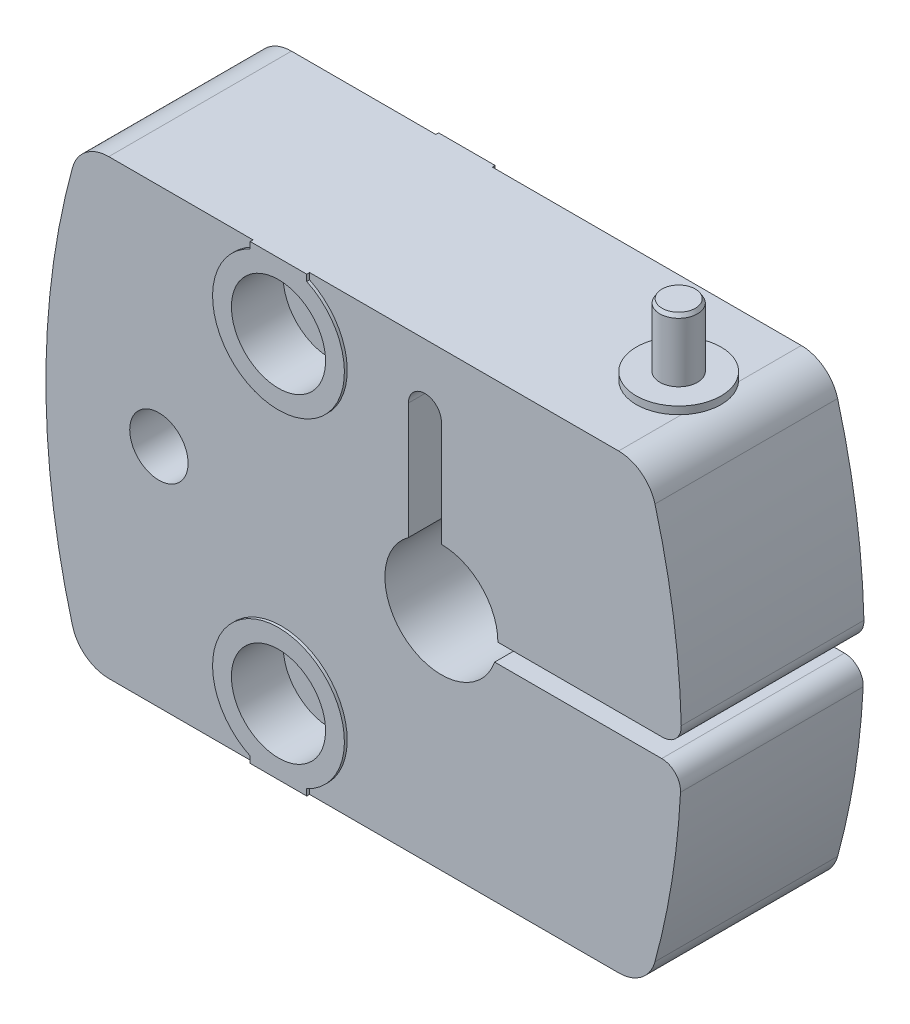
ISO-10303-21;
HEADER;
FILE_DESCRIPTION(('STEP AP214'),'2;1');
FILE_NAME('part.step','',(''),(''),'','','');
FILE_SCHEMA(('AUTOMOTIVE_DESIGN { 1 0 10303 214 1 1 1 1 }'));
ENDSEC;
DATA;
#1=APPLICATION_CONTEXT('core data for automotive mechanical design processes');
#2=APPLICATION_PROTOCOL_DEFINITION('international standard','automotive_design',2000,#1);
#3=PRODUCT_CONTEXT('',#1,'mechanical');
#4=PRODUCT('Part','Part','',(#3));
#5=PRODUCT_RELATED_PRODUCT_CATEGORY('part','',(#4));
#6=PRODUCT_DEFINITION_FORMATION('','',#4);
#7=PRODUCT_DEFINITION_CONTEXT('part definition',#1,'design');
#8=PRODUCT_DEFINITION('design','',#6,#7);
#9=PRODUCT_DEFINITION_SHAPE('','',#8);
#10=(LENGTH_UNIT() NAMED_UNIT(*) SI_UNIT(.MILLI.,.METRE.));
#11=(NAMED_UNIT(*) PLANE_ANGLE_UNIT() SI_UNIT($,.RADIAN.));
#12=(NAMED_UNIT(*) SI_UNIT($,.STERADIAN.) SOLID_ANGLE_UNIT());
#13=UNCERTAINTY_MEASURE_WITH_UNIT(LENGTH_MEASURE(1.E-05),#10,'distance_accuracy_value','');
#14=(GEOMETRIC_REPRESENTATION_CONTEXT(3) GLOBAL_UNCERTAINTY_ASSIGNED_CONTEXT((#13)) GLOBAL_UNIT_ASSIGNED_CONTEXT((#10,
#11,#12)) REPRESENTATION_CONTEXT('',''));
#15=CARTESIAN_POINT('',(0.,0.,0.));
#16=DIRECTION('',(0.,0.,1.));
#17=DIRECTION('',(1.,0.,0.));
#18=AXIS2_PLACEMENT_3D('',#15,#16,#17);
#19=CARTESIAN_POINT('',(18.8212111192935,24.,20.));
#20=DIRECTION('',(0.,-1.,0.));
#21=DIRECTION('',(0.,0.,1.));
#22=AXIS2_PLACEMENT_3D('',#19,#20,#21);
#23=PLANE('',#22);
#24=CARTESIAN_POINT('',(15.5,24.,10.));
#25=DIRECTION('',(0.,1.,0.));
#26=DIRECTION('',(0.,0.,-1.));
#27=AXIS2_PLACEMENT_3D('',#24,#25,#26);
#28=CIRCLE('',#27,4.5);
#29=CARTESIAN_POINT('',(18.8212111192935,24.,6.96362770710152));
#30=VERTEX_POINT('',#29);
#31=CARTESIAN_POINT('',(18.8212111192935,24.,13.0363722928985));
#32=VERTEX_POINT('',#31);
#33=EDGE_CURVE('E34',#30,#32,#28,.T.);
#34=ORIENTED_EDGE('',*,*,#33,.F.);
#35=DIRECTION('',(0.,0.,-1.));
#36=VECTOR('',#35,1.);
#37=CARTESIAN_POINT('',(18.8212111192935,24.,20.));
#38=LINE('',#37,#36);
#39=CARTESIAN_POINT('',(18.8212111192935,24.,0.3));
#40=VERTEX_POINT('',#39);
#41=EDGE_CURVE('E253',#30,#40,#38,.T.);
#42=ORIENTED_EDGE('',*,*,#41,.T.);
#43=DIRECTION('',(1.,0.,0.));
#44=VECTOR('',#43,1.);
#45=CARTESIAN_POINT('',(-14.,24.,0.3));
#46=LINE('',#45,#44);
#47=CARTESIAN_POINT('',(-14.,24.,0.3));
#48=VERTEX_POINT('',#47);
#49=EDGE_CURVE('E412',#48,#40,#46,.T.);
#50=ORIENTED_EDGE('',*,*,#49,.F.);
#51=DIRECTION('',(0.,0.,-1.));
#52=VECTOR('',#51,1.);
#53=CARTESIAN_POINT('',(-14.,24.,0.3));
#54=LINE('',#53,#52);
#55=CARTESIAN_POINT('',(-14.,24.,0.));
#56=VERTEX_POINT('',#55);
#57=EDGE_CURVE('E503',#48,#56,#54,.T.);
#58=ORIENTED_EDGE('',*,*,#57,.T.);
#59=DIRECTION('',(-1.,0.,0.));
#60=VECTOR('',#59,1.);
#61=CARTESIAN_POINT('',(18.8212111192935,24.,0.));
#62=LINE('',#61,#60);
#63=CARTESIAN_POINT('',(-20.,24.,0.));
#64=VERTEX_POINT('',#63);
#65=EDGE_CURVE('E496',#56,#64,#62,.T.);
#66=ORIENTED_EDGE('',*,*,#65,.T.);
#67=DIRECTION('',(0.,0.,-1.));
#68=VECTOR('',#67,1.);
#69=CARTESIAN_POINT('',(-20.,24.,0.3));
#70=LINE('',#69,#68);
#71=CARTESIAN_POINT('',(-20.,24.,0.3));
#72=VERTEX_POINT('',#71);
#73=EDGE_CURVE('E478',#72,#64,#70,.T.);
#74=ORIENTED_EDGE('',*,*,#73,.F.);
#75=DIRECTION('',(1.,0.,0.));
#76=VECTOR('',#75,1.);
#77=CARTESIAN_POINT('',(-35.3212111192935,24.,0.3));
#78=LINE('',#77,#76);
#79=CARTESIAN_POINT('',(-35.3212111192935,24.,0.3));
#80=VERTEX_POINT('',#79);
#81=EDGE_CURVE('E399',#80,#72,#78,.T.);
#82=ORIENTED_EDGE('',*,*,#81,.F.);
#83=DIRECTION('',(0.,0.,-1.));
#84=VECTOR('',#83,1.);
#85=CARTESIAN_POINT('',(-35.3212111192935,24.,20.));
#86=LINE('',#85,#84);
#87=CARTESIAN_POINT('',(-35.3212111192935,24.,19.7));
#88=VERTEX_POINT('',#87);
#89=EDGE_CURVE('E546',#88,#80,#86,.T.);
#90=ORIENTED_EDGE('',*,*,#89,.F.);
#91=DIRECTION('',(-1.,0.,0.));
#92=VECTOR('',#91,1.);
#93=CARTESIAN_POINT('',(-20.,24.,19.7));
#94=LINE('',#93,#92);
#95=CARTESIAN_POINT('',(-20.,24.,19.7));
#96=VERTEX_POINT('',#95);
#97=EDGE_CURVE('E329',#96,#88,#94,.T.);
#98=ORIENTED_EDGE('',*,*,#97,.F.);
#99=DIRECTION('',(0.,0.,1.));
#100=VECTOR('',#99,1.);
#101=CARTESIAN_POINT('',(-20.,24.,-82.5057277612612));
#102=LINE('',#101,#100);
#103=CARTESIAN_POINT('',(-20.,24.,20.));
#104=VERTEX_POINT('',#103);
#105=EDGE_CURVE('E331',#96,#104,#102,.T.);
#106=ORIENTED_EDGE('',*,*,#105,.T.);
#107=DIRECTION('',(-1.,0.,0.));
#108=VECTOR('',#107,1.);
#109=CARTESIAN_POINT('',(18.8212111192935,24.,20.));
#110=LINE('',#109,#108);
#111=CARTESIAN_POINT('',(-14.,24.,20.));
#112=VERTEX_POINT('',#111);
#113=EDGE_CURVE('E511',#112,#104,#110,.T.);
#114=ORIENTED_EDGE('',*,*,#113,.F.);
#115=DIRECTION('',(0.,0.,1.));
#116=VECTOR('',#115,1.);
#117=CARTESIAN_POINT('',(-14.,24.,-82.5057277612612));
#118=LINE('',#117,#116);
#119=CARTESIAN_POINT('',(-14.,24.,19.7));
#120=VERTEX_POINT('',#119);
#121=EDGE_CURVE('E343',#120,#112,#118,.T.);
#122=ORIENTED_EDGE('',*,*,#121,.F.);
#123=DIRECTION('',(-1.,0.,0.));
#124=VECTOR('',#123,1.);
#125=CARTESIAN_POINT('',(18.8212111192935,24.,19.7));
#126=LINE('',#125,#124);
#127=CARTESIAN_POINT('',(18.8212111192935,24.,19.7));
#128=VERTEX_POINT('',#127);
#129=EDGE_CURVE('E249',#128,#120,#126,.T.);
#130=ORIENTED_EDGE('',*,*,#129,.F.);
#131=EDGE_CURVE('E245',#128,#32,#38,.T.);
#132=ORIENTED_EDGE('',*,*,#131,.T.);
#133=EDGE_LOOP('',(#34,#42,#50,#58,#66,#74,#82,#90,#98,#106,#114,#122,#130,#132));
#134=FACE_BOUND('',#133,.T.);
#135=ADVANCED_FACE('F18',(#134),#23,.F.);
#136=CARTESIAN_POINT('',(-17.,17.,20.));
#137=DIRECTION('',(0.,0.,-1.));
#138=DIRECTION('',(0.,-1.,0.));
#139=AXIS2_PLACEMENT_3D('',#136,#137,#138);
#140=CYLINDRICAL_SURFACE('',#139,2.75);
#141=CARTESIAN_POINT('',(-17.,17.,5.5));
#142=DIRECTION('',(0.,0.,-1.));
#143=DIRECTION('',(0.,-1.,0.));
#144=AXIS2_PLACEMENT_3D('',#141,#142,#143);
#145=CIRCLE('',#144,2.75);
#146=CARTESIAN_POINT('',(-17.,14.25,5.5));
#147=VERTEX_POINT('',#146);
#148=EDGE_CURVE('E304',#147,#147,#145,.T.);
#149=ORIENTED_EDGE('',*,*,#148,.T.);
#150=EDGE_LOOP('',(#149));
#151=FACE_BOUND('',#150,.T.);
#152=CARTESIAN_POINT('',(-17.,17.,14.5));
#153=DIRECTION('',(0.,0.,1.));
#154=DIRECTION('',(0.,1.,0.));
#155=AXIS2_PLACEMENT_3D('',#152,#153,#154);
#156=CIRCLE('',#155,2.75);
#157=CARTESIAN_POINT('',(-17.,19.75,14.5));
#158=VERTEX_POINT('',#157);
#159=EDGE_CURVE('E284',#158,#158,#156,.T.);
#160=ORIENTED_EDGE('',*,*,#159,.T.);
#161=EDGE_LOOP('',(#160));
#162=FACE_BOUND('',#161,.T.);
#163=ADVANCED_FACE('F588',(#151,#162),#140,.F.);
#164=CARTESIAN_POINT('',(-17.,-17.,20.));
#165=DIRECTION('',(0.,0.,-1.));
#166=DIRECTION('',(0.,-1.,0.));
#167=AXIS2_PLACEMENT_3D('',#164,#165,#166);
#168=CYLINDRICAL_SURFACE('',#167,2.75);
#169=CARTESIAN_POINT('',(-17.,-17.,5.5));
#170=DIRECTION('',(0.,0.,-1.));
#171=DIRECTION('',(0.,-1.,0.));
#172=AXIS2_PLACEMENT_3D('',#169,#170,#171);
#173=CIRCLE('',#172,2.75);
#174=CARTESIAN_POINT('',(-17.,-19.75,5.5));
#175=VERTEX_POINT('',#174);
#176=EDGE_CURVE('E297',#175,#175,#173,.T.);
#177=ORIENTED_EDGE('',*,*,#176,.T.);
#178=EDGE_LOOP('',(#177));
#179=FACE_BOUND('',#178,.T.);
#180=CARTESIAN_POINT('',(-17.,-17.,14.5));
#181=DIRECTION('',(0.,0.,1.));
#182=DIRECTION('',(0.,1.,0.));
#183=AXIS2_PLACEMENT_3D('',#180,#181,#182);
#184=CIRCLE('',#183,2.75);
#185=CARTESIAN_POINT('',(-17.,-14.25,14.5));
#186=VERTEX_POINT('',#185);
#187=EDGE_CURVE('E290',#186,#186,#184,.T.);
#188=ORIENTED_EDGE('',*,*,#187,.T.);
#189=EDGE_LOOP('',(#188));
#190=FACE_BOUND('',#189,.T.);
#191=ADVANCED_FACE('F594',(#179,#190),#168,.F.);
#192=CARTESIAN_POINT('',(0.,0.,20.));
#193=DIRECTION('',(0.,0.,1.));
#194=DIRECTION('',(0.,1.,0.));
#195=AXIS2_PLACEMENT_3D('',#192,#193,#194);
#196=PLANE('',#195);
#197=CARTESIAN_POINT('',(-17.,-17.,20.));
#198=DIRECTION('',(0.,0.,1.));
#199=DIRECTION('',(0.,1.,0.));
#200=AXIS2_PLACEMENT_3D('',#197,#198,#199);
#201=CIRCLE('',#200,5.);
#202=CARTESIAN_POINT('',(-17.,-12.,20.));
#203=VERTEX_POINT('',#202);
#204=EDGE_CURVE('E291',#203,#203,#201,.T.);
#205=ORIENTED_EDGE('',*,*,#204,.F.);
#206=EDGE_LOOP('',(#205));
#207=FACE_BOUND('',#206,.T.);
#208=DIRECTION('',(0.,1.,0.));
#209=VECTOR('',#208,1.);
#210=CARTESIAN_POINT('',(-20.,-24.,20.));
#211=LINE('',#210,#209);
#212=CARTESIAN_POINT('',(-20.,-24.,20.));
#213=VERTEX_POINT('',#212);
#214=CARTESIAN_POINT('',(-20.,-23.3245553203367,20.));
#215=VERTEX_POINT('',#214);
#216=EDGE_CURVE('E321',#213,#215,#211,.T.);
#217=ORIENTED_EDGE('',*,*,#216,.F.);
#218=DIRECTION('',(1.,0.,0.));
#219=VECTOR('',#218,1.);
#220=CARTESIAN_POINT('',(-35.3212111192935,-24.,20.));
#221=LINE('',#220,#219);
#222=CARTESIAN_POINT('',(-14.,-24.,20.));
#223=VERTEX_POINT('',#222);
#224=EDGE_CURVE('E514',#213,#223,#221,.T.);
#225=ORIENTED_EDGE('',*,*,#224,.T.);
#226=DIRECTION('',(0.,-1.,0.));
#227=VECTOR('',#226,1.);
#228=CARTESIAN_POINT('',(-14.,-23.3245553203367,20.));
#229=LINE('',#228,#227);
#230=CARTESIAN_POINT('',(-14.,-23.3245553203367,20.));
#231=VERTEX_POINT('',#230);
#232=EDGE_CURVE('E42',#231,#223,#229,.T.);
#233=ORIENTED_EDGE('',*,*,#232,.F.);
#234=CARTESIAN_POINT('',(-17.,-17.,20.));
#235=DIRECTION('',(0.,0.,-1.));
#236=DIRECTION('',(0.,1.,0.));
#237=AXIS2_PLACEMENT_3D('',#234,#235,#236);
#238=CIRCLE('',#237,7.);
#239=EDGE_CURVE('E318',#215,#231,#238,.T.);
#240=ORIENTED_EDGE('',*,*,#239,.F.);
#241=EDGE_LOOP('',(#217,#225,#233,#240));
#242=FACE_BOUND('',#241,.T.);
#243=ADVANCED_FACE('F622',(#207,#242),#196,.T.);
#244=CARTESIAN_POINT('',(0.,0.,0.));
#245=DIRECTION('',(0.,0.,1.));
#246=DIRECTION('',(0.,1.,0.));
#247=AXIS2_PLACEMENT_3D('',#244,#245,#246);
#248=PLANE('',#247);
#249=CARTESIAN_POINT('',(-17.,-17.,0.));
#250=DIRECTION('',(0.,0.,-1.));
#251=DIRECTION('',(0.,-1.,0.));
#252=AXIS2_PLACEMENT_3D('',#249,#250,#251);
#253=CIRCLE('',#252,5.);
#254=CARTESIAN_POINT('',(-17.,-22.,0.));
#255=VERTEX_POINT('',#254);
#256=EDGE_CURVE('E298',#255,#255,#253,.T.);
#257=ORIENTED_EDGE('',*,*,#256,.F.);
#258=EDGE_LOOP('',(#257));
#259=FACE_BOUND('',#258,.T.);
#260=DIRECTION('',(1.,0.,0.));
#261=VECTOR('',#260,1.);
#262=CARTESIAN_POINT('',(-35.3212111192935,-24.,0.));
#263=LINE('',#262,#261);
#264=CARTESIAN_POINT('',(-20.,-24.,0.));
#265=VERTEX_POINT('',#264);
#266=CARTESIAN_POINT('',(-14.,-24.,0.));
#267=VERTEX_POINT('',#266);
#268=EDGE_CURVE('E515',#265,#267,#263,.T.);
#269=ORIENTED_EDGE('',*,*,#268,.F.);
#270=DIRECTION('',(0.,-1.,0.));
#271=VECTOR('',#270,1.);
#272=CARTESIAN_POINT('',(-20.,-23.3245553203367,0.));
#273=LINE('',#272,#271);
#274=CARTESIAN_POINT('',(-20.,-23.3245553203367,0.));
#275=VERTEX_POINT('',#274);
#276=EDGE_CURVE('E403',#275,#265,#273,.T.);
#277=ORIENTED_EDGE('',*,*,#276,.F.);
#278=CARTESIAN_POINT('',(-17.,-17.,0.));
#279=DIRECTION('',(0.,0.,1.));
#280=DIRECTION('',(0.,1.,0.));
#281=AXIS2_PLACEMENT_3D('',#278,#279,#280);
#282=CIRCLE('',#281,7.);
#283=CARTESIAN_POINT('',(-14.,-23.3245553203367,0.));
#284=VERTEX_POINT('',#283);
#285=EDGE_CURVE('E489',#284,#275,#282,.T.);
#286=ORIENTED_EDGE('',*,*,#285,.F.);
#287=DIRECTION('',(0.,1.,0.));
#288=VECTOR('',#287,1.);
#289=CARTESIAN_POINT('',(-14.,-23.3245553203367,0.));
#290=LINE('',#289,#288);
#291=EDGE_CURVE('E486',#267,#284,#290,.T.);
#292=ORIENTED_EDGE('',*,*,#291,.F.);
#293=EDGE_LOOP('',(#269,#277,#286,#292));
#294=FACE_BOUND('',#293,.T.);
#295=ADVANCED_FACE('F616',(#259,#294),#248,.F.);
#296=CARTESIAN_POINT('',(0.,0.,20.));
#297=DIRECTION('',(0.,0.,-1.));
#298=DIRECTION('',(0.,-1.,0.));
#299=AXIS2_PLACEMENT_3D('',#296,#297,#298);
#300=CYLINDRICAL_SURFACE('',#299,6.);
#301=DIRECTION('',(0.,0.,-1.));
#302=VECTOR('',#301,1.);
#303=CARTESIAN_POINT('',(6.,0.,20.));
#304=LINE('',#303,#302);
#305=CARTESIAN_POINT('',(6.,0.,19.7));
#306=VERTEX_POINT('',#305);
#307=CARTESIAN_POINT('',(6.,0.,0.3));
#308=VERTEX_POINT('',#307);
#309=EDGE_CURVE('E553',#306,#308,#304,.T.);
#310=ORIENTED_EDGE('',*,*,#309,.F.);
#311=CARTESIAN_POINT('',(0.,0.,19.7));
#312=DIRECTION('',(0.,0.,-1.));
#313=DIRECTION('',(0.,-1.,0.));
#314=AXIS2_PLACEMENT_3D('',#311,#312,#313);
#315=CIRCLE('',#314,6.);
#316=CARTESIAN_POINT('',(0.,6.,19.7));
#317=VERTEX_POINT('',#316);
#318=EDGE_CURVE('E353',#317,#306,#315,.T.);
#319=ORIENTED_EDGE('',*,*,#318,.F.);
#320=DIRECTION('',(0.,0.,-1.));
#321=VECTOR('',#320,1.);
#322=CARTESIAN_POINT('',(0.,6.,20.));
#323=LINE('',#322,#321);
#324=CARTESIAN_POINT('',(0.,6.,0.3));
#325=VERTEX_POINT('',#324);
#326=EDGE_CURVE('E518',#317,#325,#323,.T.);
#327=ORIENTED_EDGE('',*,*,#326,.T.);
#328=CARTESIAN_POINT('',(0.,0.,0.3));
#329=DIRECTION('',(0.,0.,1.));
#330=DIRECTION('',(0.,-1.,0.));
#331=AXIS2_PLACEMENT_3D('',#328,#329,#330);
#332=CIRCLE('',#331,6.);
#333=EDGE_CURVE('E427',#308,#325,#332,.T.);
#334=ORIENTED_EDGE('',*,*,#333,.F.);
#335=EDGE_LOOP('',(#310,#319,#327,#334));
#336=FACE_BOUND('',#335,.T.);
#337=ADVANCED_FACE('F613',(#336),#300,.F.);
#338=CARTESIAN_POINT('',(6.,0.,20.));
#339=DIRECTION('',(0.,1.,0.));
#340=DIRECTION('',(-1.,0.,0.));
#341=AXIS2_PLACEMENT_3D('',#338,#339,#340);
#342=PLANE('',#341);
#343=CARTESIAN_POINT('',(15.5,0.,10.));
#344=DIRECTION('',(0.,1.,0.));
#345=DIRECTION('',(-1.,0.,0.));
#346=AXIS2_PLACEMENT_3D('',#343,#344,#345);
#347=CIRCLE('',#346,2.);
#348=CARTESIAN_POINT('',(13.5,0.,10.));
#349=VERTEX_POINT('',#348);
#350=EDGE_CURVE('E277',#349,#349,#347,.T.);
#351=ORIENTED_EDGE('',*,*,#350,.T.);
#352=EDGE_LOOP('',(#351));
#353=FACE_BOUND('',#352,.T.);
#354=DIRECTION('',(0.,0.,-1.));
#355=VECTOR('',#354,1.);
#356=CARTESIAN_POINT('',(23.4743547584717,0.,20.));
#357=LINE('',#356,#355);
#358=CARTESIAN_POINT('',(23.4743547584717,0.,19.7));
#359=VERTEX_POINT('',#358);
#360=CARTESIAN_POINT('',(23.4743547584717,0.,0.3));
#361=VERTEX_POINT('',#360);
#362=EDGE_CURVE('E551',#359,#361,#357,.T.);
#363=ORIENTED_EDGE('',*,*,#362,.F.);
#364=DIRECTION('',(1.,0.,0.));
#365=VECTOR('',#364,1.);
#366=CARTESIAN_POINT('',(6.,0.,19.7));
#367=LINE('',#366,#365);
#368=EDGE_CURVE('E351',#306,#359,#367,.T.);
#369=ORIENTED_EDGE('',*,*,#368,.F.);
#370=ORIENTED_EDGE('',*,*,#309,.T.);
#371=DIRECTION('',(-1.,0.,0.));
#372=VECTOR('',#371,1.);
#373=CARTESIAN_POINT('',(23.4743547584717,0.,0.3));
#374=LINE('',#373,#372);
#375=EDGE_CURVE('E424',#361,#308,#374,.T.);
#376=ORIENTED_EDGE('',*,*,#375,.F.);
#377=EDGE_LOOP('',(#363,#369,#370,#376));
#378=FACE_BOUND('',#377,.T.);
#379=ADVANCED_FACE('F610',(#353,#378),#342,.F.);
#380=CARTESIAN_POINT('',(23.4743547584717,2.,20.));
#381=DIRECTION('',(0.,0.,-1.));
#382=DIRECTION('',(0.,-1.,0.));
#383=AXIS2_PLACEMENT_3D('',#380,#381,#382);
#384=CYLINDRICAL_SURFACE('',#383,2.);
#385=DIRECTION('',(0.,0.,-1.));
#386=VECTOR('',#385,1.);
#387=CARTESIAN_POINT('',(25.4736971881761,2.05128205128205,20.));
#388=LINE('',#387,#386);
#389=CARTESIAN_POINT('',(25.4736971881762,2.05128205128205,19.7));
#390=VERTEX_POINT('',#389);
#391=CARTESIAN_POINT('',(25.4736971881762,2.05128205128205,0.3));
#392=VERTEX_POINT('',#391);
#393=EDGE_CURVE('E549',#390,#392,#388,.T.);
#394=ORIENTED_EDGE('',*,*,#393,.F.);
#395=CARTESIAN_POINT('',(23.4743547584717,2.,19.7));
#396=DIRECTION('',(0.,0.,-1.));
#397=DIRECTION('',(0.,-1.,0.));
#398=AXIS2_PLACEMENT_3D('',#395,#396,#397);
#399=CIRCLE('',#398,2.);
#400=EDGE_CURVE('E349',#359,#390,#399,.F.);
#401=ORIENTED_EDGE('',*,*,#400,.F.);
#402=ORIENTED_EDGE('',*,*,#362,.T.);
#403=CARTESIAN_POINT('',(23.4743547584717,2.,0.3));
#404=DIRECTION('',(0.,0.,-1.));
#405=DIRECTION('',(0.,-1.,0.));
#406=AXIS2_PLACEMENT_3D('',#403,#404,#405);
#407=CIRCLE('',#406,2.);
#408=EDGE_CURVE('E421',#392,#361,#407,.T.);
#409=ORIENTED_EDGE('',*,*,#408,.F.);
#410=EDGE_LOOP('',(#394,#401,#402,#409));
#411=FACE_BOUND('',#410,.T.);
#412=ADVANCED_FACE('F606',(#411),#384,.T.);
#413=CARTESIAN_POINT('',(-54.5,0.,20.));
#414=DIRECTION('',(0.,0.,-1.));
#415=DIRECTION('',(0.,-1.,0.));
#416=AXIS2_PLACEMENT_3D('',#413,#414,#415);
#417=CYLINDRICAL_SURFACE('',#416,80.);
#418=DIRECTION('',(0.,0.,-1.));
#419=VECTOR('',#418,1.);
#420=CARTESIAN_POINT('',(22.6802222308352,21.0526315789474,20.));
#421=LINE('',#420,#419);
#422=CARTESIAN_POINT('',(22.6802222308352,21.0526315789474,19.7));
#423=VERTEX_POINT('',#422);
#424=CARTESIAN_POINT('',(22.6802222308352,21.0526315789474,0.3));
#425=VERTEX_POINT('',#424);
#426=EDGE_CURVE('E252',#423,#425,#421,.T.);
#427=ORIENTED_EDGE('',*,*,#426,.F.);
#428=CARTESIAN_POINT('',(-54.5,0.,19.7));
#429=DIRECTION('',(0.,0.,-1.));
#430=DIRECTION('',(0.,-1.,0.));
#431=AXIS2_PLACEMENT_3D('',#428,#429,#430);
#432=CIRCLE('',#431,80.);
#433=EDGE_CURVE('E347',#390,#423,#432,.F.);
#434=ORIENTED_EDGE('',*,*,#433,.F.);
#435=ORIENTED_EDGE('',*,*,#393,.T.);
#436=CARTESIAN_POINT('',(-54.5,0.,0.3));
#437=DIRECTION('',(0.,0.,-1.));
#438=DIRECTION('',(0.,-1.,0.));
#439=AXIS2_PLACEMENT_3D('',#436,#437,#438);
#440=CIRCLE('',#439,80.);
#441=EDGE_CURVE('E418',#425,#392,#440,.T.);
#442=ORIENTED_EDGE('',*,*,#441,.F.);
#443=EDGE_LOOP('',(#427,#434,#435,#442));
#444=FACE_BOUND('',#443,.T.);
#445=ADVANCED_FACE('F603',(#444),#417,.T.);
#446=CARTESIAN_POINT('',(18.8212111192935,20.,20.));
#447=DIRECTION('',(0.,0.,-1.));
#448=DIRECTION('',(0.,-1.,0.));
#449=AXIS2_PLACEMENT_3D('',#446,#447,#448);
#450=CYLINDRICAL_SURFACE('',#449,4.);
#451=ORIENTED_EDGE('',*,*,#131,.F.);
#452=CARTESIAN_POINT('',(18.8212111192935,20.,19.7));
#453=DIRECTION('',(0.,0.,-1.));
#454=DIRECTION('',(0.,-1.,0.));
#455=AXIS2_PLACEMENT_3D('',#452,#453,#454);
#456=CIRCLE('',#455,4.);
#457=EDGE_CURVE('E345',#423,#128,#456,.F.);
#458=ORIENTED_EDGE('',*,*,#457,.F.);
#459=ORIENTED_EDGE('',*,*,#426,.T.);
#460=CARTESIAN_POINT('',(18.8212111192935,20.,0.3));
#461=DIRECTION('',(0.,0.,-1.));
#462=DIRECTION('',(0.,-1.,0.));
#463=AXIS2_PLACEMENT_3D('',#460,#461,#462);
#464=CIRCLE('',#463,4.);
#465=EDGE_CURVE('E415',#40,#425,#464,.T.);
#466=ORIENTED_EDGE('',*,*,#465,.F.);
#467=ORIENTED_EDGE('',*,*,#41,.F.);
#468=DIRECTION('',(0.,0.,-1.));
#469=VECTOR('',#468,1.);
#470=CARTESIAN_POINT('',(18.8212111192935,24.,20.));
#471=LINE('',#470,#469);
#472=EDGE_CURVE('E256',#32,#30,#471,.T.);
#473=ORIENTED_EDGE('',*,*,#472,.F.);
#474=EDGE_LOOP('',(#451,#458,#459,#466,#467,#473));
#475=FACE_BOUND('',#474,.T.);
#476=ADVANCED_FACE('F257',(#475),#450,.T.);
#477=CARTESIAN_POINT('',(-35.3212111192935,20.,20.));
#478=DIRECTION('',(0.,0.,-1.));
#479=DIRECTION('',(0.,-1.,0.));
#480=AXIS2_PLACEMENT_3D('',#477,#478,#479);
#481=CYLINDRICAL_SURFACE('',#480,4.);
#482=DIRECTION('',(0.,0.,-1.));
#483=VECTOR('',#482,1.);
#484=CARTESIAN_POINT('',(-39.1802222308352,21.0526315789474,20.));
#485=LINE('',#484,#483);
#486=CARTESIAN_POINT('',(-39.1802222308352,21.0526315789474,19.7));
#487=VERTEX_POINT('',#486);
#488=CARTESIAN_POINT('',(-39.1802222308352,21.0526315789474,0.3));
#489=VERTEX_POINT('',#488);
#490=EDGE_CURVE('E544',#487,#489,#485,.T.);
#491=ORIENTED_EDGE('',*,*,#490,.F.);
#492=CARTESIAN_POINT('',(-35.3212111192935,20.,19.7));
#493=DIRECTION('',(0.,0.,-1.));
#494=DIRECTION('',(0.,-1.,0.));
#495=AXIS2_PLACEMENT_3D('',#492,#493,#494);
#496=CIRCLE('',#495,4.);
#497=EDGE_CURVE('E326',#88,#487,#496,.F.);
#498=ORIENTED_EDGE('',*,*,#497,.F.);
#499=ORIENTED_EDGE('',*,*,#89,.T.);
#500=CARTESIAN_POINT('',(-35.3212111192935,20.,0.3));
#501=DIRECTION('',(0.,0.,-1.));
#502=DIRECTION('',(0.,-1.,0.));
#503=AXIS2_PLACEMENT_3D('',#500,#501,#502);
#504=CIRCLE('',#503,4.);
#505=EDGE_CURVE('E475',#489,#80,#504,.T.);
#506=ORIENTED_EDGE('',*,*,#505,.F.);
#507=EDGE_LOOP('',(#491,#498,#499,#506));
#508=FACE_BOUND('',#507,.T.);
#509=ADVANCED_FACE('F599',(#508),#481,.T.);
#510=CARTESIAN_POINT('',(38.,0.,20.));
#511=DIRECTION('',(0.,0.,-1.));
#512=DIRECTION('',(0.,-1.,0.));
#513=AXIS2_PLACEMENT_3D('',#510,#511,#512);
#514=CYLINDRICAL_SURFACE('',#513,80.);
#515=DIRECTION('',(0.,0.,-1.));
#516=VECTOR('',#515,1.);
#517=CARTESIAN_POINT('',(-39.1802222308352,-21.0526315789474,20.));
#518=LINE('',#517,#516);
#519=CARTESIAN_POINT('',(-39.1802222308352,-21.0526315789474,19.7));
#520=VERTEX_POINT('',#519);
#521=CARTESIAN_POINT('',(-39.1802222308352,-21.0526315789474,0.3));
#522=VERTEX_POINT('',#521);
#523=EDGE_CURVE('E542',#520,#522,#518,.T.);
#524=ORIENTED_EDGE('',*,*,#523,.F.);
#525=CARTESIAN_POINT('',(38.,0.,19.7));
#526=DIRECTION('',(0.,0.,-1.));
#527=DIRECTION('',(0.,-1.,0.));
#528=AXIS2_PLACEMENT_3D('',#525,#526,#527);
#529=CIRCLE('',#528,80.);
#530=EDGE_CURVE('E310',#487,#520,#529,.F.);
#531=ORIENTED_EDGE('',*,*,#530,.F.);
#532=ORIENTED_EDGE('',*,*,#490,.T.);
#533=CARTESIAN_POINT('',(38.,0.,0.3));
#534=DIRECTION('',(0.,0.,-1.));
#535=DIRECTION('',(0.,-1.,0.));
#536=AXIS2_PLACEMENT_3D('',#533,#534,#535);
#537=CIRCLE('',#536,80.);
#538=EDGE_CURVE('E472',#522,#489,#537,.T.);
#539=ORIENTED_EDGE('',*,*,#538,.F.);
#540=EDGE_LOOP('',(#524,#531,#532,#539));
#541=FACE_BOUND('',#540,.T.);
#542=ADVANCED_FACE('F669',(#541),#514,.T.);
#543=CARTESIAN_POINT('',(-35.3212111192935,-20.,20.));
#544=DIRECTION('',(0.,0.,-1.));
#545=DIRECTION('',(0.,-1.,0.));
#546=AXIS2_PLACEMENT_3D('',#543,#544,#545);
#547=CYLINDRICAL_SURFACE('',#546,4.);
#548=DIRECTION('',(0.,0.,-1.));
#549=VECTOR('',#548,1.);
#550=CARTESIAN_POINT('',(-35.3212111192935,-24.,20.));
#551=LINE('',#550,#549);
#552=CARTESIAN_POINT('',(-35.3212111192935,-24.,19.7));
#553=VERTEX_POINT('',#552);
#554=CARTESIAN_POINT('',(-35.3212111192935,-24.,0.3));
#555=VERTEX_POINT('',#554);
#556=EDGE_CURVE('E540',#553,#555,#551,.T.);
#557=ORIENTED_EDGE('',*,*,#556,.F.);
#558=CARTESIAN_POINT('',(-35.3212111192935,-20.,19.7));
#559=DIRECTION('',(0.,0.,-1.));
#560=DIRECTION('',(0.,-1.,0.));
#561=AXIS2_PLACEMENT_3D('',#558,#559,#560);
#562=CIRCLE('',#561,4.);
#563=EDGE_CURVE('E325',#520,#553,#562,.F.);
#564=ORIENTED_EDGE('',*,*,#563,.F.);
#565=ORIENTED_EDGE('',*,*,#523,.T.);
#566=CARTESIAN_POINT('',(-35.3212111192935,-20.,0.3));
#567=DIRECTION('',(0.,0.,-1.));
#568=DIRECTION('',(0.,-1.,0.));
#569=AXIS2_PLACEMENT_3D('',#566,#567,#568);
#570=CIRCLE('',#569,4.);
#571=EDGE_CURVE('E469',#555,#522,#570,.T.);
#572=ORIENTED_EDGE('',*,*,#571,.F.);
#573=EDGE_LOOP('',(#557,#564,#565,#572));
#574=FACE_BOUND('',#573,.T.);
#575=ADVANCED_FACE('F673',(#574),#547,.T.);
#576=CARTESIAN_POINT('',(18.8212111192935,-20.,20.));
#577=DIRECTION('',(0.,0.,-1.));
#578=DIRECTION('',(0.,-1.,0.));
#579=AXIS2_PLACEMENT_3D('',#576,#577,#578);
#580=CYLINDRICAL_SURFACE('',#579,4.);
#581=DIRECTION('',(0.,0.,-1.));
#582=VECTOR('',#581,1.);
#583=CARTESIAN_POINT('',(22.6802222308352,-21.0526315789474,20.));
#584=LINE('',#583,#582);
#585=CARTESIAN_POINT('',(22.6802222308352,-21.0526315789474,19.7));
#586=VERTEX_POINT('',#585);
#587=CARTESIAN_POINT('',(22.6802222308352,-21.0526315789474,0.3));
#588=VERTEX_POINT('',#587);
#589=EDGE_CURVE('E536',#586,#588,#584,.T.);
#590=ORIENTED_EDGE('',*,*,#589,.F.);
#591=CARTESIAN_POINT('',(18.8212111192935,-20.,19.7));
#592=DIRECTION('',(0.,0.,-1.));
#593=DIRECTION('',(0.,-1.,0.));
#594=AXIS2_PLACEMENT_3D('',#591,#592,#593);
#595=CIRCLE('',#594,4.);
#596=CARTESIAN_POINT('',(18.8212111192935,-24.,19.7));
#597=VERTEX_POINT('',#596);
#598=EDGE_CURVE('E369',#597,#586,#595,.F.);
#599=ORIENTED_EDGE('',*,*,#598,.F.);
#600=DIRECTION('',(0.,0.,-1.));
#601=VECTOR('',#600,1.);
#602=CARTESIAN_POINT('',(18.8212111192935,-24.,20.));
#603=LINE('',#602,#601);
#604=CARTESIAN_POINT('',(18.8212111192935,-24.,0.3));
#605=VERTEX_POINT('',#604);
#606=EDGE_CURVE('E538',#597,#605,#603,.T.);
#607=ORIENTED_EDGE('',*,*,#606,.T.);
#608=CARTESIAN_POINT('',(18.8212111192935,-20.,0.3));
#609=DIRECTION('',(0.,0.,-1.));
#610=DIRECTION('',(0.,-1.,0.));
#611=AXIS2_PLACEMENT_3D('',#608,#609,#610);
#612=CIRCLE('',#611,4.);
#613=EDGE_CURVE('E451',#588,#605,#612,.T.);
#614=ORIENTED_EDGE('',*,*,#613,.F.);
#615=EDGE_LOOP('',(#590,#599,#607,#614));
#616=FACE_BOUND('',#615,.T.);
#617=ADVANCED_FACE('F699',(#616),#580,.T.);
#618=CARTESIAN_POINT('',(-54.5,0.,20.));
#619=DIRECTION('',(0.,0.,-1.));
#620=DIRECTION('',(0.,-1.,0.));
#621=AXIS2_PLACEMENT_3D('',#618,#619,#620);
#622=CYLINDRICAL_SURFACE('',#621,80.);
#623=DIRECTION('',(0.,0.,-1.));
#624=VECTOR('',#623,1.);
#625=CARTESIAN_POINT('',(25.3947367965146,-4.1025641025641,20.));
#626=LINE('',#625,#624);
#627=CARTESIAN_POINT('',(25.3947367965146,-4.1025641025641,19.7));
#628=VERTEX_POINT('',#627);
#629=CARTESIAN_POINT('',(25.3947367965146,-4.1025641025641,0.3));
#630=VERTEX_POINT('',#629);
#631=EDGE_CURVE('E534',#628,#630,#626,.T.);
#632=ORIENTED_EDGE('',*,*,#631,.F.);
#633=CARTESIAN_POINT('',(-54.5,0.,19.7));
#634=DIRECTION('',(0.,0.,-1.));
#635=DIRECTION('',(0.,-1.,0.));
#636=AXIS2_PLACEMENT_3D('',#633,#634,#635);
#637=CIRCLE('',#636,80.);
#638=EDGE_CURVE('E367',#586,#628,#637,.F.);
#639=ORIENTED_EDGE('',*,*,#638,.F.);
#640=ORIENTED_EDGE('',*,*,#589,.T.);
#641=CARTESIAN_POINT('',(-54.5,0.,0.3));
#642=DIRECTION('',(0.,0.,-1.));
#643=DIRECTION('',(0.,-1.,0.));
#644=AXIS2_PLACEMENT_3D('',#641,#642,#643);
#645=CIRCLE('',#644,80.);
#646=EDGE_CURVE('E448',#630,#588,#645,.T.);
#647=ORIENTED_EDGE('',*,*,#646,.F.);
#648=EDGE_LOOP('',(#632,#639,#640,#647));
#649=FACE_BOUND('',#648,.T.);
#650=ADVANCED_FACE('F704',(#649),#622,.T.);
#651=CARTESIAN_POINT('',(23.3973683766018,-4.,20.));
#652=DIRECTION('',(0.,0.,-1.));
#653=DIRECTION('',(0.,-1.,0.));
#654=AXIS2_PLACEMENT_3D('',#651,#652,#653);
#655=CYLINDRICAL_SURFACE('',#654,2.);
#656=DIRECTION('',(0.,0.,-1.));
#657=VECTOR('',#656,1.);
#658=CARTESIAN_POINT('',(23.3973683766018,-2.,20.));
#659=LINE('',#658,#657);
#660=CARTESIAN_POINT('',(23.3973683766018,-2.,19.7));
#661=VERTEX_POINT('',#660);
#662=CARTESIAN_POINT('',(23.3973683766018,-2.,0.3));
#663=VERTEX_POINT('',#662);
#664=EDGE_CURVE('E532',#661,#663,#659,.T.);
#665=ORIENTED_EDGE('',*,*,#664,.F.);
#666=CARTESIAN_POINT('',(23.3973683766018,-4.,19.7));
#667=DIRECTION('',(0.,0.,-1.));
#668=DIRECTION('',(0.,-1.,0.));
#669=AXIS2_PLACEMENT_3D('',#666,#667,#668);
#670=CIRCLE('',#669,2.);
#671=EDGE_CURVE('E365',#628,#661,#670,.F.);
#672=ORIENTED_EDGE('',*,*,#671,.F.);
#673=ORIENTED_EDGE('',*,*,#631,.T.);
#674=CARTESIAN_POINT('',(23.3973683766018,-4.,0.3));
#675=DIRECTION('',(0.,0.,-1.));
#676=DIRECTION('',(0.,-1.,0.));
#677=AXIS2_PLACEMENT_3D('',#674,#675,#676);
#678=CIRCLE('',#677,2.);
#679=EDGE_CURVE('E445',#663,#630,#678,.T.);
#680=ORIENTED_EDGE('',*,*,#679,.F.);
#681=EDGE_LOOP('',(#665,#672,#673,#680));
#682=FACE_BOUND('',#681,.T.);
#683=ADVANCED_FACE('F710',(#682),#655,.T.);
#684=CARTESIAN_POINT('',(23.3973683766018,-2.,20.));
#685=DIRECTION('',(0.,-1.,0.));
#686=DIRECTION('',(1.,0.,0.));
#687=AXIS2_PLACEMENT_3D('',#684,#685,#686);
#688=PLANE('',#687);
#689=CARTESIAN_POINT('',(15.5,-2.00000000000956,10.));
#690=DIRECTION('',(0.,-1.,0.));
#691=DIRECTION('',(1.,0.,0.));
#692=AXIS2_PLACEMENT_3D('',#689,#690,#691);
#693=CIRCLE('',#692,2.);
#694=CARTESIAN_POINT('',(17.5,-2.00000000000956,10.));
#695=VERTEX_POINT('',#694);
#696=EDGE_CURVE('E262',#695,#695,#693,.F.);
#697=ORIENTED_EDGE('',*,*,#696,.F.);
#698=EDGE_LOOP('',(#697));
#699=FACE_BOUND('',#698,.T.);
#700=DIRECTION('',(0.,0.,-1.));
#701=VECTOR('',#700,1.);
#702=CARTESIAN_POINT('',(5.6568542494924,-2.,20.));
#703=LINE('',#702,#701);
#704=CARTESIAN_POINT('',(5.6568542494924,-2.,19.7));
#705=VERTEX_POINT('',#704);
#706=CARTESIAN_POINT('',(5.6568542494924,-2.,0.3));
#707=VERTEX_POINT('',#706);
#708=EDGE_CURVE('E530',#705,#707,#703,.T.);
#709=ORIENTED_EDGE('',*,*,#708,.F.);
#710=DIRECTION('',(-1.,0.,0.));
#711=VECTOR('',#710,1.);
#712=CARTESIAN_POINT('',(23.3973683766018,-2.,19.7));
#713=LINE('',#712,#711);
#714=EDGE_CURVE('E363',#661,#705,#713,.T.);
#715=ORIENTED_EDGE('',*,*,#714,.F.);
#716=ORIENTED_EDGE('',*,*,#664,.T.);
#717=DIRECTION('',(1.,0.,0.));
#718=VECTOR('',#717,1.);
#719=CARTESIAN_POINT('',(5.6568542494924,-2.,0.3));
#720=LINE('',#719,#718);
#721=EDGE_CURVE('E442',#707,#663,#720,.T.);
#722=ORIENTED_EDGE('',*,*,#721,.F.);
#723=EDGE_LOOP('',(#709,#715,#716,#722));
#724=FACE_BOUND('',#723,.T.);
#725=ADVANCED_FACE('F714',(#699,#724),#688,.F.);
#726=CARTESIAN_POINT('',(0.,0.,20.));
#727=DIRECTION('',(0.,0.,-1.));
#728=DIRECTION('',(0.,-1.,0.));
#729=AXIS2_PLACEMENT_3D('',#726,#727,#728);
#730=CYLINDRICAL_SURFACE('',#729,6.);
#731=DIRECTION('',(0.,0.,-1.));
#732=VECTOR('',#731,1.);
#733=CARTESIAN_POINT('',(-3.5,4.8733971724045,20.));
#734=LINE('',#733,#732);
#735=CARTESIAN_POINT('',(-3.5,4.8733971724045,19.7));
#736=VERTEX_POINT('',#735);
#737=CARTESIAN_POINT('',(-3.5,4.8733971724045,0.3));
#738=VERTEX_POINT('',#737);
#739=EDGE_CURVE('E528',#736,#738,#734,.T.);
#740=ORIENTED_EDGE('',*,*,#739,.F.);
#741=CARTESIAN_POINT('',(0.,0.,19.7));
#742=DIRECTION('',(0.,0.,-1.));
#743=DIRECTION('',(0.,-1.,0.));
#744=AXIS2_PLACEMENT_3D('',#741,#742,#743);
#745=CIRCLE('',#744,6.);
#746=EDGE_CURVE('E361',#705,#736,#745,.T.);
#747=ORIENTED_EDGE('',*,*,#746,.F.);
#748=ORIENTED_EDGE('',*,*,#708,.T.);
#749=CARTESIAN_POINT('',(0.,0.,0.3));
#750=DIRECTION('',(0.,0.,1.));
#751=DIRECTION('',(0.,-1.,0.));
#752=AXIS2_PLACEMENT_3D('',#749,#750,#751);
#753=CIRCLE('',#752,6.);
#754=EDGE_CURVE('E439',#738,#707,#753,.T.);
#755=ORIENTED_EDGE('',*,*,#754,.F.);
#756=EDGE_LOOP('',(#740,#747,#748,#755));
#757=FACE_BOUND('',#756,.T.);
#758=ADVANCED_FACE('F719',(#757),#730,.F.);
#759=CARTESIAN_POINT('',(-3.5,17.25,20.));
#760=DIRECTION('',(-1.,0.,0.));
#761=DIRECTION('',(0.,-1.,0.));
#762=AXIS2_PLACEMENT_3D('',#759,#760,#761);
#763=PLANE('',#762);
#764=DIRECTION('',(0.,0.,-1.));
#765=VECTOR('',#764,1.);
#766=CARTESIAN_POINT('',(-3.5,17.25,20.));
#767=LINE('',#766,#765);
#768=CARTESIAN_POINT('',(-3.5,17.25,19.7));
#769=VERTEX_POINT('',#768);
#770=CARTESIAN_POINT('',(-3.5,17.25,0.3));
#771=VERTEX_POINT('',#770);
#772=EDGE_CURVE('E526',#769,#771,#767,.T.);
#773=ORIENTED_EDGE('',*,*,#772,.F.);
#774=DIRECTION('',(0.,1.,0.));
#775=VECTOR('',#774,1.);
#776=CARTESIAN_POINT('',(-3.5,4.8733971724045,19.7));
#777=LINE('',#776,#775);
#778=EDGE_CURVE('E359',#736,#769,#777,.T.);
#779=ORIENTED_EDGE('',*,*,#778,.F.);
#780=ORIENTED_EDGE('',*,*,#739,.T.);
#781=DIRECTION('',(0.,-1.,0.));
#782=VECTOR('',#781,1.);
#783=CARTESIAN_POINT('',(-3.5,17.25,0.3));
#784=LINE('',#783,#782);
#785=EDGE_CURVE('E436',#771,#738,#784,.T.);
#786=ORIENTED_EDGE('',*,*,#785,.F.);
#787=EDGE_LOOP('',(#773,#779,#780,#786));
#788=FACE_BOUND('',#787,.T.);
#789=ADVANCED_FACE('F725',(#788),#763,.F.);
#790=CARTESIAN_POINT('',(-1.75,17.25,20.));
#791=DIRECTION('',(0.,0.,-1.));
#792=DIRECTION('',(0.,-1.,0.));
#793=AXIS2_PLACEMENT_3D('',#790,#791,#792);
#794=CYLINDRICAL_SURFACE('',#793,1.75);
#795=DIRECTION('',(0.,0.,-1.));
#796=VECTOR('',#795,1.);
#797=CARTESIAN_POINT('',(0.,17.25,20.));
#798=LINE('',#797,#796);
#799=CARTESIAN_POINT('',(0.,17.25,19.7));
#800=VERTEX_POINT('',#799);
#801=CARTESIAN_POINT('',(0.,17.25,0.3));
#802=VERTEX_POINT('',#801);
#803=EDGE_CURVE('E524',#800,#802,#798,.T.);
#804=ORIENTED_EDGE('',*,*,#803,.F.);
#805=CARTESIAN_POINT('',(-1.75,17.25,19.7));
#806=DIRECTION('',(0.,0.,-1.));
#807=DIRECTION('',(0.,-1.,0.));
#808=AXIS2_PLACEMENT_3D('',#805,#806,#807);
#809=CIRCLE('',#808,1.75);
#810=EDGE_CURVE('E357',#769,#800,#809,.T.);
#811=ORIENTED_EDGE('',*,*,#810,.F.);
#812=ORIENTED_EDGE('',*,*,#772,.T.);
#813=CARTESIAN_POINT('',(-1.75,17.25,0.3));
#814=DIRECTION('',(0.,0.,1.));
#815=DIRECTION('',(0.,-1.,0.));
#816=AXIS2_PLACEMENT_3D('',#813,#814,#815);
#817=CIRCLE('',#816,1.75);
#818=EDGE_CURVE('E433',#802,#771,#817,.T.);
#819=ORIENTED_EDGE('',*,*,#818,.F.);
#820=EDGE_LOOP('',(#804,#811,#812,#819));
#821=FACE_BOUND('',#820,.T.);
#822=ADVANCED_FACE('F729',(#821),#794,.F.);
#823=CARTESIAN_POINT('',(0.,6.,20.));
#824=DIRECTION('',(1.,0.,0.));
#825=DIRECTION('',(0.,0.,-1.));
#826=AXIS2_PLACEMENT_3D('',#823,#824,#825);
#827=PLANE('',#826);
#828=ORIENTED_EDGE('',*,*,#326,.F.);
#829=DIRECTION('',(0.,-1.,0.));
#830=VECTOR('',#829,1.);
#831=CARTESIAN_POINT('',(0.,17.25,19.7));
#832=LINE('',#831,#830);
#833=EDGE_CURVE('E355',#800,#317,#832,.T.);
#834=ORIENTED_EDGE('',*,*,#833,.F.);
#835=ORIENTED_EDGE('',*,*,#803,.T.);
#836=DIRECTION('',(0.,1.,0.));
#837=VECTOR('',#836,1.);
#838=CARTESIAN_POINT('',(0.,6.,0.3));
#839=LINE('',#838,#837);
#840=EDGE_CURVE('E430',#325,#802,#839,.T.);
#841=ORIENTED_EDGE('',*,*,#840,.F.);
#842=EDGE_LOOP('',(#828,#834,#835,#841));
#843=FACE_BOUND('',#842,.T.);
#844=ADVANCED_FACE('F731',(#843),#827,.F.);
#845=CARTESIAN_POINT('',(-17.,17.,20.));
#846=DIRECTION('',(0.,0.,1.));
#847=DIRECTION('',(0.,1.,0.));
#848=AXIS2_PLACEMENT_3D('',#845,#846,#847);
#849=CIRCLE('',#848,5.);
#850=CARTESIAN_POINT('',(-17.,22.,20.));
#851=VERTEX_POINT('',#850);
#852=EDGE_CURVE('E280',#851,#851,#849,.T.);
#853=ORIENTED_EDGE('',*,*,#852,.F.);
#854=EDGE_LOOP('',(#853));
#855=FACE_BOUND('',#854,.T.);
#856=DIRECTION('',(0.,-1.,0.));
#857=VECTOR('',#856,1.);
#858=CARTESIAN_POINT('',(-14.,24.,20.));
#859=LINE('',#858,#857);
#860=CARTESIAN_POINT('',(-14.,23.3245553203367,20.));
#861=VERTEX_POINT('',#860);
#862=EDGE_CURVE('E314',#112,#861,#859,.T.);
#863=ORIENTED_EDGE('',*,*,#862,.F.);
#864=ORIENTED_EDGE('',*,*,#113,.T.);
#865=DIRECTION('',(0.,1.,0.));
#866=VECTOR('',#865,1.);
#867=CARTESIAN_POINT('',(-20.,23.3245553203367,20.));
#868=LINE('',#867,#866);
#869=CARTESIAN_POINT('',(-20.,23.3245553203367,20.));
#870=VERTEX_POINT('',#869);
#871=EDGE_CURVE('E308',#870,#104,#868,.T.);
#872=ORIENTED_EDGE('',*,*,#871,.F.);
#873=CARTESIAN_POINT('',(-17.,17.,20.));
#874=DIRECTION('',(0.,0.,-1.));
#875=DIRECTION('',(0.,1.,0.));
#876=AXIS2_PLACEMENT_3D('',#873,#874,#875);
#877=CIRCLE('',#876,7.);
#878=EDGE_CURVE('E311',#861,#870,#877,.T.);
#879=ORIENTED_EDGE('',*,*,#878,.F.);
#880=EDGE_LOOP('',(#863,#864,#872,#879));
#881=FACE_BOUND('',#880,.T.);
#882=ADVANCED_FACE('F734',(#855,#881),#196,.T.);
#883=CARTESIAN_POINT('',(-17.,17.,0.));
#884=DIRECTION('',(0.,0.,-1.));
#885=DIRECTION('',(0.,-1.,0.));
#886=AXIS2_PLACEMENT_3D('',#883,#884,#885);
#887=CIRCLE('',#886,5.);
#888=CARTESIAN_POINT('',(-17.,12.,0.));
#889=VERTEX_POINT('',#888);
#890=EDGE_CURVE('E305',#889,#889,#887,.T.);
#891=ORIENTED_EDGE('',*,*,#890,.F.);
#892=EDGE_LOOP('',(#891));
#893=FACE_BOUND('',#892,.T.);
#894=ORIENTED_EDGE('',*,*,#65,.F.);
#895=DIRECTION('',(0.,1.,0.));
#896=VECTOR('',#895,1.);
#897=CARTESIAN_POINT('',(-14.,23.3245553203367,0.));
#898=LINE('',#897,#896);
#899=CARTESIAN_POINT('',(-14.,23.3245553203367,0.));
#900=VERTEX_POINT('',#899);
#901=EDGE_CURVE('E484',#900,#56,#898,.T.);
#902=ORIENTED_EDGE('',*,*,#901,.F.);
#903=CARTESIAN_POINT('',(-17.,17.,0.));
#904=DIRECTION('',(0.,0.,1.));
#905=DIRECTION('',(0.,-1.,0.));
#906=AXIS2_PLACEMENT_3D('',#903,#904,#905);
#907=CIRCLE('',#906,7.);
#908=CARTESIAN_POINT('',(-20.,23.3245553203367,0.));
#909=VERTEX_POINT('',#908);
#910=EDGE_CURVE('E481',#909,#900,#907,.T.);
#911=ORIENTED_EDGE('',*,*,#910,.F.);
#912=DIRECTION('',(0.,-1.,0.));
#913=VECTOR('',#912,1.);
#914=CARTESIAN_POINT('',(-20.,23.3245553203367,0.));
#915=LINE('',#914,#913);
#916=EDGE_CURVE('E328',#64,#909,#915,.T.);
#917=ORIENTED_EDGE('',*,*,#916,.F.);
#918=EDGE_LOOP('',(#894,#902,#911,#917));
#919=FACE_BOUND('',#918,.T.);
#920=ADVANCED_FACE('F625',(#893,#919),#248,.F.);
#921=CARTESIAN_POINT('',(-35.3212111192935,-24.,20.));
#922=DIRECTION('',(0.,1.,0.));
#923=DIRECTION('',(0.,0.,-1.));
#924=AXIS2_PLACEMENT_3D('',#921,#922,#923);
#925=PLANE('',#924);
#926=DIRECTION('',(0.,0.,1.));
#927=VECTOR('',#926,1.);
#928=CARTESIAN_POINT('',(-20.,-24.,-82.5057277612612));
#929=LINE('',#928,#927);
#930=CARTESIAN_POINT('',(-20.,-24.,19.7));
#931=VERTEX_POINT('',#930);
#932=EDGE_CURVE('E385',#931,#213,#929,.T.);
#933=ORIENTED_EDGE('',*,*,#932,.F.);
#934=DIRECTION('',(1.,0.,0.));
#935=VECTOR('',#934,1.);
#936=CARTESIAN_POINT('',(-35.3212111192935,-24.,19.7));
#937=LINE('',#936,#935);
#938=EDGE_CURVE('E386',#553,#931,#937,.T.);
#939=ORIENTED_EDGE('',*,*,#938,.F.);
#940=ORIENTED_EDGE('',*,*,#556,.T.);
#941=DIRECTION('',(-1.,0.,0.));
#942=VECTOR('',#941,1.);
#943=CARTESIAN_POINT('',(-20.,-24.,0.3));
#944=LINE('',#943,#942);
#945=CARTESIAN_POINT('',(-20.,-24.,0.3));
#946=VERTEX_POINT('',#945);
#947=EDGE_CURVE('E466',#946,#555,#944,.T.);
#948=ORIENTED_EDGE('',*,*,#947,.F.);
#949=DIRECTION('',(0.,0.,-1.));
#950=VECTOR('',#949,1.);
#951=CARTESIAN_POINT('',(-20.,-24.,0.3));
#952=LINE('',#951,#950);
#953=EDGE_CURVE('E493',#946,#265,#952,.T.);
#954=ORIENTED_EDGE('',*,*,#953,.T.);
#955=ORIENTED_EDGE('',*,*,#268,.T.);
#956=DIRECTION('',(0.,0.,-1.));
#957=VECTOR('',#956,1.);
#958=CARTESIAN_POINT('',(-14.,-24.,0.3));
#959=LINE('',#958,#957);
#960=CARTESIAN_POINT('',(-14.,-24.,0.3));
#961=VERTEX_POINT('',#960);
#962=EDGE_CURVE('E501',#961,#267,#959,.T.);
#963=ORIENTED_EDGE('',*,*,#962,.F.);
#964=DIRECTION('',(-1.,0.,0.));
#965=VECTOR('',#964,1.);
#966=CARTESIAN_POINT('',(18.8212111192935,-24.,0.3));
#967=LINE('',#966,#965);
#968=EDGE_CURVE('E454',#605,#961,#967,.T.);
#969=ORIENTED_EDGE('',*,*,#968,.F.);
#970=ORIENTED_EDGE('',*,*,#606,.F.);
#971=DIRECTION('',(1.,0.,0.));
#972=VECTOR('',#971,1.);
#973=CARTESIAN_POINT('',(-14.,-24.,19.7));
#974=LINE('',#973,#972);
#975=CARTESIAN_POINT('',(-14.,-24.,19.7));
#976=VERTEX_POINT('',#975);
#977=EDGE_CURVE('E371',#976,#597,#974,.T.);
#978=ORIENTED_EDGE('',*,*,#977,.F.);
#979=DIRECTION('',(0.,0.,1.));
#980=VECTOR('',#979,1.);
#981=CARTESIAN_POINT('',(-14.,-24.,-82.5057277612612));
#982=LINE('',#981,#980);
#983=EDGE_CURVE('E373',#976,#223,#982,.T.);
#984=ORIENTED_EDGE('',*,*,#983,.T.);
#985=ORIENTED_EDGE('',*,*,#224,.F.);
#986=EDGE_LOOP('',(#933,#939,#940,#948,#954,#955,#963,#969,#970,#978,#984,#985));
#987=FACE_BOUND('',#986,.T.);
#988=ADVANCED_FACE('F678',(#987),#925,.F.);
#989=CARTESIAN_POINT('',(-20.,-23.3245553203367,0.3));
#990=DIRECTION('',(1.,0.,0.));
#991=DIRECTION('',(0.,1.,0.));
#992=AXIS2_PLACEMENT_3D('',#989,#990,#991);
#993=PLANE('',#992);
#994=ORIENTED_EDGE('',*,*,#276,.T.);
#995=ORIENTED_EDGE('',*,*,#953,.F.);
#996=DIRECTION('',(0.,-1.,0.));
#997=VECTOR('',#996,1.);
#998=CARTESIAN_POINT('',(-20.,-23.3245553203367,0.3));
#999=LINE('',#998,#997);
#1000=CARTESIAN_POINT('',(-20.,-23.3245553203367,0.3));
#1001=VERTEX_POINT('',#1000);
#1002=EDGE_CURVE('E463',#1001,#946,#999,.T.);
#1003=ORIENTED_EDGE('',*,*,#1002,.F.);
#1004=DIRECTION('',(0.,0.,-1.));
#1005=VECTOR('',#1004,1.);
#1006=CARTESIAN_POINT('',(-20.,-23.3245553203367,0.3));
#1007=LINE('',#1006,#1005);
#1008=EDGE_CURVE('E497',#1001,#275,#1007,.T.);
#1009=ORIENTED_EDGE('',*,*,#1008,.T.);
#1010=EDGE_LOOP('',(#994,#995,#1003,#1009));
#1011=FACE_BOUND('',#1010,.T.);
#1012=ADVANCED_FACE('F760',(#1011),#993,.F.);
#1013=CARTESIAN_POINT('',(-17.,-17.,0.3));
#1014=DIRECTION('',(0.,0.,-1.));
#1015=DIRECTION('',(0.,-1.,0.));
#1016=AXIS2_PLACEMENT_3D('',#1013,#1014,#1015);
#1017=CYLINDRICAL_SURFACE('',#1016,7.);
#1018=ORIENTED_EDGE('',*,*,#285,.T.);
#1019=ORIENTED_EDGE('',*,*,#1008,.F.);
#1020=CARTESIAN_POINT('',(-17.,-17.,0.3));
#1021=DIRECTION('',(0.,0.,1.));
#1022=DIRECTION('',(0.,1.,0.));
#1023=AXIS2_PLACEMENT_3D('',#1020,#1021,#1022);
#1024=CIRCLE('',#1023,7.);
#1025=CARTESIAN_POINT('',(-14.,-23.3245553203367,0.3));
#1026=VERTEX_POINT('',#1025);
#1027=EDGE_CURVE('E460',#1026,#1001,#1024,.T.);
#1028=ORIENTED_EDGE('',*,*,#1027,.F.);
#1029=DIRECTION('',(0.,0.,-1.));
#1030=VECTOR('',#1029,1.);
#1031=CARTESIAN_POINT('',(-14.,-23.3245553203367,0.3));
#1032=LINE('',#1031,#1030);
#1033=EDGE_CURVE('E499',#1026,#284,#1032,.T.);
#1034=ORIENTED_EDGE('',*,*,#1033,.T.);
#1035=EDGE_LOOP('',(#1018,#1019,#1028,#1034));
#1036=FACE_BOUND('',#1035,.T.);
#1037=ADVANCED_FACE('F893',(#1036),#1017,.T.);
#1038=CARTESIAN_POINT('',(-14.,-23.3245553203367,0.3));
#1039=DIRECTION('',(-1.,0.,0.));
#1040=DIRECTION('',(0.,0.,1.));
#1041=AXIS2_PLACEMENT_3D('',#1038,#1039,#1040);
#1042=PLANE('',#1041);
#1043=ORIENTED_EDGE('',*,*,#291,.T.);
#1044=ORIENTED_EDGE('',*,*,#1033,.F.);
#1045=DIRECTION('',(0.,1.,0.));
#1046=VECTOR('',#1045,1.);
#1047=CARTESIAN_POINT('',(-14.,-23.3245553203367,0.3));
#1048=LINE('',#1047,#1046);
#1049=EDGE_CURVE('E457',#961,#1026,#1048,.T.);
#1050=ORIENTED_EDGE('',*,*,#1049,.F.);
#1051=ORIENTED_EDGE('',*,*,#962,.T.);
#1052=EDGE_LOOP('',(#1043,#1044,#1050,#1051));
#1053=FACE_BOUND('',#1052,.T.);
#1054=ADVANCED_FACE('F901',(#1053),#1042,.F.);
#1055=CARTESIAN_POINT('',(-14.,23.3245553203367,0.3));
#1056=DIRECTION('',(-1.,0.,0.));
#1057=DIRECTION('',(0.,0.,1.));
#1058=AXIS2_PLACEMENT_3D('',#1055,#1056,#1057);
#1059=PLANE('',#1058);
#1060=ORIENTED_EDGE('',*,*,#901,.T.);
#1061=ORIENTED_EDGE('',*,*,#57,.F.);
#1062=DIRECTION('',(0.,1.,0.));
#1063=VECTOR('',#1062,1.);
#1064=CARTESIAN_POINT('',(-14.,23.3245553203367,0.3));
#1065=LINE('',#1064,#1063);
#1066=CARTESIAN_POINT('',(-14.,23.3245553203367,0.3));
#1067=VERTEX_POINT('',#1066);
#1068=EDGE_CURVE('E409',#1067,#48,#1065,.T.);
#1069=ORIENTED_EDGE('',*,*,#1068,.F.);
#1070=DIRECTION('',(0.,0.,-1.));
#1071=VECTOR('',#1070,1.);
#1072=CARTESIAN_POINT('',(-14.,23.3245553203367,0.3));
#1073=LINE('',#1072,#1071);
#1074=EDGE_CURVE('E506',#1067,#900,#1073,.T.);
#1075=ORIENTED_EDGE('',*,*,#1074,.T.);
#1076=EDGE_LOOP('',(#1060,#1061,#1069,#1075));
#1077=FACE_BOUND('',#1076,.T.);
#1078=ADVANCED_FACE('F910',(#1077),#1059,.F.);
#1079=CARTESIAN_POINT('',(-17.,17.,0.3));
#1080=DIRECTION('',(0.,0.,-1.));
#1081=DIRECTION('',(0.,-1.,0.));
#1082=AXIS2_PLACEMENT_3D('',#1079,#1080,#1081);
#1083=CYLINDRICAL_SURFACE('',#1082,7.);
#1084=ORIENTED_EDGE('',*,*,#910,.T.);
#1085=ORIENTED_EDGE('',*,*,#1074,.F.);
#1086=CARTESIAN_POINT('',(-17.,17.,0.3));
#1087=DIRECTION('',(0.,0.,1.));
#1088=DIRECTION('',(0.,-1.,0.));
#1089=AXIS2_PLACEMENT_3D('',#1086,#1087,#1088);
#1090=CIRCLE('',#1089,7.);
#1091=CARTESIAN_POINT('',(-20.,23.3245553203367,0.3));
#1092=VERTEX_POINT('',#1091);
#1093=EDGE_CURVE('E406',#1092,#1067,#1090,.T.);
#1094=ORIENTED_EDGE('',*,*,#1093,.F.);
#1095=DIRECTION('',(0.,0.,-1.));
#1096=VECTOR('',#1095,1.);
#1097=CARTESIAN_POINT('',(-20.,23.3245553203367,0.3));
#1098=LINE('',#1097,#1096);
#1099=EDGE_CURVE('E508',#1092,#909,#1098,.T.);
#1100=ORIENTED_EDGE('',*,*,#1099,.T.);
#1101=EDGE_LOOP('',(#1084,#1085,#1094,#1100));
#1102=FACE_BOUND('',#1101,.T.);
#1103=ADVANCED_FACE('F919',(#1102),#1083,.T.);
#1104=CARTESIAN_POINT('',(-20.,23.3245553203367,0.3));
#1105=DIRECTION('',(1.,0.,0.));
#1106=DIRECTION('',(0.,0.,-1.));
#1107=AXIS2_PLACEMENT_3D('',#1104,#1105,#1106);
#1108=PLANE('',#1107);
#1109=ORIENTED_EDGE('',*,*,#916,.T.);
#1110=ORIENTED_EDGE('',*,*,#1099,.F.);
#1111=DIRECTION('',(0.,-1.,0.));
#1112=VECTOR('',#1111,1.);
#1113=CARTESIAN_POINT('',(-20.,23.3245553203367,0.3));
#1114=LINE('',#1113,#1112);
#1115=EDGE_CURVE('E402',#72,#1092,#1114,.T.);
#1116=ORIENTED_EDGE('',*,*,#1115,.F.);
#1117=ORIENTED_EDGE('',*,*,#73,.T.);
#1118=EDGE_LOOP('',(#1109,#1110,#1116,#1117));
#1119=FACE_BOUND('',#1118,.T.);
#1120=ADVANCED_FACE('F655',(#1119),#1108,.F.);
#1121=CARTESIAN_POINT('',(-17.,17.,0.3));
#1122=DIRECTION('',(0.,0.,-1.));
#1123=DIRECTION('',(0.,-1.,0.));
#1124=AXIS2_PLACEMENT_3D('',#1121,#1122,#1123);
#1125=PLANE('',#1124);
#1126=CARTESIAN_POINT('',(-30.,0.,0.3));
#1127=DIRECTION('',(0.,0.,-1.));
#1128=DIRECTION('',(-1.,0.,0.));
#1129=AXIS2_PLACEMENT_3D('',#1126,#1127,#1128);
#1130=CIRCLE('',#1129,3.1);
#1131=CARTESIAN_POINT('',(-33.1,0.,0.3));
#1132=VERTEX_POINT('',#1131);
#1133=EDGE_CURVE('E268',#1132,#1132,#1130,.F.);
#1134=ORIENTED_EDGE('',*,*,#1133,.T.);
#1135=EDGE_LOOP('',(#1134));
#1136=FACE_BOUND('',#1135,.T.);
#1137=ORIENTED_EDGE('',*,*,#81,.T.);
#1138=ORIENTED_EDGE('',*,*,#1115,.T.);
#1139=ORIENTED_EDGE('',*,*,#1093,.T.);
#1140=ORIENTED_EDGE('',*,*,#1068,.T.);
#1141=ORIENTED_EDGE('',*,*,#49,.T.);
#1142=ORIENTED_EDGE('',*,*,#465,.T.);
#1143=ORIENTED_EDGE('',*,*,#441,.T.);
#1144=ORIENTED_EDGE('',*,*,#408,.T.);
#1145=ORIENTED_EDGE('',*,*,#375,.T.);
#1146=ORIENTED_EDGE('',*,*,#333,.T.);
#1147=ORIENTED_EDGE('',*,*,#840,.T.);
#1148=ORIENTED_EDGE('',*,*,#818,.T.);
#1149=ORIENTED_EDGE('',*,*,#785,.T.);
#1150=ORIENTED_EDGE('',*,*,#754,.T.);
#1151=ORIENTED_EDGE('',*,*,#721,.T.);
#1152=ORIENTED_EDGE('',*,*,#679,.T.);
#1153=ORIENTED_EDGE('',*,*,#646,.T.);
#1154=ORIENTED_EDGE('',*,*,#613,.T.);
#1155=ORIENTED_EDGE('',*,*,#968,.T.);
#1156=ORIENTED_EDGE('',*,*,#1049,.T.);
#1157=ORIENTED_EDGE('',*,*,#1027,.T.);
#1158=ORIENTED_EDGE('',*,*,#1002,.T.);
#1159=ORIENTED_EDGE('',*,*,#947,.T.);
#1160=ORIENTED_EDGE('',*,*,#571,.T.);
#1161=ORIENTED_EDGE('',*,*,#538,.T.);
#1162=ORIENTED_EDGE('',*,*,#505,.T.);
#1163=EDGE_LOOP('',(#1137,#1138,#1139,#1140,#1141,#1142,#1143,#1144,#1145,#1146,#1147,#1148,
#1149,#1150,#1151,#1152,#1153,#1154,#1155,#1156,#1157,#1158,#1159,#1160,#1161,#1162));
#1164=FACE_BOUND('',#1163,.T.);
#1165=ADVANCED_FACE('F635',(#1136,#1164),#1125,.T.);
#1166=CARTESIAN_POINT('',(-17.,17.,19.7));
#1167=DIRECTION('',(0.,0.,-1.));
#1168=DIRECTION('',(0.,-1.,0.));
#1169=AXIS2_PLACEMENT_3D('',#1166,#1167,#1168);
#1170=PLANE('',#1169);
#1171=CARTESIAN_POINT('',(-30.,0.,19.7));
#1172=DIRECTION('',(0.,0.,-1.));
#1173=DIRECTION('',(-1.,0.,0.));
#1174=AXIS2_PLACEMENT_3D('',#1171,#1172,#1173);
#1175=CIRCLE('',#1174,3.1);
#1176=CARTESIAN_POINT('',(-33.1,0.,19.7));
#1177=VERTEX_POINT('',#1176);
#1178=EDGE_CURVE('E22',#1177,#1177,#1175,.F.);
#1179=ORIENTED_EDGE('',*,*,#1178,.F.);
#1180=EDGE_LOOP('',(#1179));
#1181=FACE_BOUND('',#1180,.T.);
#1182=ORIENTED_EDGE('',*,*,#497,.T.);
#1183=ORIENTED_EDGE('',*,*,#530,.T.);
#1184=ORIENTED_EDGE('',*,*,#563,.T.);
#1185=ORIENTED_EDGE('',*,*,#938,.T.);
#1186=DIRECTION('',(0.,1.,0.));
#1187=VECTOR('',#1186,1.);
#1188=CARTESIAN_POINT('',(-20.,-24.,19.7));
#1189=LINE('',#1188,#1187);
#1190=CARTESIAN_POINT('',(-20.,-23.3245553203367,19.7));
#1191=VERTEX_POINT('',#1190);
#1192=EDGE_CURVE('E382',#931,#1191,#1189,.T.);
#1193=ORIENTED_EDGE('',*,*,#1192,.T.);
#1194=CARTESIAN_POINT('',(-17.,-17.,19.7));
#1195=DIRECTION('',(0.,0.,-1.));
#1196=DIRECTION('',(0.,-1.,0.));
#1197=AXIS2_PLACEMENT_3D('',#1194,#1195,#1196);
#1198=CIRCLE('',#1197,7.);
#1199=CARTESIAN_POINT('',(-14.,-23.3245553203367,19.7));
#1200=VERTEX_POINT('',#1199);
#1201=EDGE_CURVE('E378',#1191,#1200,#1198,.T.);
#1202=ORIENTED_EDGE('',*,*,#1201,.T.);
#1203=DIRECTION('',(0.,-1.,0.));
#1204=VECTOR('',#1203,1.);
#1205=CARTESIAN_POINT('',(-14.,-23.3245553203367,19.7));
#1206=LINE('',#1205,#1204);
#1207=EDGE_CURVE('E374',#1200,#976,#1206,.T.);
#1208=ORIENTED_EDGE('',*,*,#1207,.T.);
#1209=ORIENTED_EDGE('',*,*,#977,.T.);
#1210=ORIENTED_EDGE('',*,*,#598,.T.);
#1211=ORIENTED_EDGE('',*,*,#638,.T.);
#1212=ORIENTED_EDGE('',*,*,#671,.T.);
#1213=ORIENTED_EDGE('',*,*,#714,.T.);
#1214=ORIENTED_EDGE('',*,*,#746,.T.);
#1215=ORIENTED_EDGE('',*,*,#778,.T.);
#1216=ORIENTED_EDGE('',*,*,#810,.T.);
#1217=ORIENTED_EDGE('',*,*,#833,.T.);
#1218=ORIENTED_EDGE('',*,*,#318,.T.);
#1219=ORIENTED_EDGE('',*,*,#368,.T.);
#1220=ORIENTED_EDGE('',*,*,#400,.T.);
#1221=ORIENTED_EDGE('',*,*,#433,.T.);
#1222=ORIENTED_EDGE('',*,*,#457,.T.);
#1223=ORIENTED_EDGE('',*,*,#129,.T.);
#1224=DIRECTION('',(0.,-1.,0.));
#1225=VECTOR('',#1224,1.);
#1226=CARTESIAN_POINT('',(-14.,24.,19.7));
#1227=LINE('',#1226,#1225);
#1228=CARTESIAN_POINT('',(-14.,23.3245553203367,19.7));
#1229=VERTEX_POINT('',#1228);
#1230=EDGE_CURVE('E340',#120,#1229,#1227,.T.);
#1231=ORIENTED_EDGE('',*,*,#1230,.T.);
#1232=CARTESIAN_POINT('',(-17.,17.,19.7));
#1233=DIRECTION('',(0.,0.,-1.));
#1234=DIRECTION('',(0.,-1.,0.));
#1235=AXIS2_PLACEMENT_3D('',#1232,#1233,#1234);
#1236=CIRCLE('',#1235,7.);
#1237=CARTESIAN_POINT('',(-20.,23.3245553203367,19.7));
#1238=VERTEX_POINT('',#1237);
#1239=EDGE_CURVE('E336',#1229,#1238,#1236,.T.);
#1240=ORIENTED_EDGE('',*,*,#1239,.T.);
#1241=DIRECTION('',(0.,1.,0.));
#1242=VECTOR('',#1241,1.);
#1243=CARTESIAN_POINT('',(-20.,23.3245553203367,19.7));
#1244=LINE('',#1243,#1242);
#1245=EDGE_CURVE('E332',#1238,#96,#1244,.T.);
#1246=ORIENTED_EDGE('',*,*,#1245,.T.);
#1247=ORIENTED_EDGE('',*,*,#97,.T.);
#1248=EDGE_LOOP('',(#1182,#1183,#1184,#1185,#1193,#1202,#1208,#1209,#1210,#1211,#1212,#1213,
#1214,#1215,#1216,#1217,#1218,#1219,#1220,#1221,#1222,#1223,#1231,#1240,#1246,#1247));
#1249=FACE_BOUND('',#1248,.T.);
#1250=ADVANCED_FACE('F643',(#1181,#1249),#1170,.F.);
#1251=CARTESIAN_POINT('',(-20.,-24.,-82.5057277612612));
#1252=DIRECTION('',(1.,0.,0.));
#1253=DIRECTION('',(0.,1.,0.));
#1254=AXIS2_PLACEMENT_3D('',#1251,#1252,#1253);
#1255=PLANE('',#1254);
#1256=ORIENTED_EDGE('',*,*,#932,.T.);
#1257=ORIENTED_EDGE('',*,*,#216,.T.);
#1258=DIRECTION('',(0.,0.,1.));
#1259=VECTOR('',#1258,1.);
#1260=CARTESIAN_POINT('',(-20.,-23.3245553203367,-82.5057277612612));
#1261=LINE('',#1260,#1259);
#1262=EDGE_CURVE('E381',#1191,#215,#1261,.T.);
#1263=ORIENTED_EDGE('',*,*,#1262,.F.);
#1264=ORIENTED_EDGE('',*,*,#1192,.F.);
#1265=EDGE_LOOP('',(#1256,#1257,#1263,#1264));
#1266=FACE_BOUND('',#1265,.T.);
#1267=ADVANCED_FACE('F684',(#1266),#1255,.F.);
#1268=CARTESIAN_POINT('',(-17.,-17.,-82.5057277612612));
#1269=DIRECTION('',(0.,0.,1.));
#1270=DIRECTION('',(0.,1.,0.));
#1271=AXIS2_PLACEMENT_3D('',#1268,#1269,#1270);
#1272=CYLINDRICAL_SURFACE('',#1271,7.);
#1273=ORIENTED_EDGE('',*,*,#1262,.T.);
#1274=ORIENTED_EDGE('',*,*,#239,.T.);
#1275=DIRECTION('',(0.,0.,1.));
#1276=VECTOR('',#1275,1.);
#1277=CARTESIAN_POINT('',(-14.,-23.3245553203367,-82.5057277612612));
#1278=LINE('',#1277,#1276);
#1279=EDGE_CURVE('E377',#1200,#231,#1278,.T.);
#1280=ORIENTED_EDGE('',*,*,#1279,.F.);
#1281=ORIENTED_EDGE('',*,*,#1201,.F.);
#1282=EDGE_LOOP('',(#1273,#1274,#1280,#1281));
#1283=FACE_BOUND('',#1282,.T.);
#1284=ADVANCED_FACE('F688',(#1283),#1272,.T.);
#1285=CARTESIAN_POINT('',(-14.,-23.3245553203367,-82.5057277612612));
#1286=DIRECTION('',(-1.,0.,0.));
#1287=DIRECTION('',(0.,0.,1.));
#1288=AXIS2_PLACEMENT_3D('',#1285,#1286,#1287);
#1289=PLANE('',#1288);
#1290=ORIENTED_EDGE('',*,*,#1279,.T.);
#1291=ORIENTED_EDGE('',*,*,#232,.T.);
#1292=ORIENTED_EDGE('',*,*,#983,.F.);
#1293=ORIENTED_EDGE('',*,*,#1207,.F.);
#1294=EDGE_LOOP('',(#1290,#1291,#1292,#1293));
#1295=FACE_BOUND('',#1294,.T.);
#1296=ADVANCED_FACE('F690',(#1295),#1289,.F.);
#1297=CARTESIAN_POINT('',(-14.,24.,-82.5057277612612));
#1298=DIRECTION('',(-1.,0.,0.));
#1299=DIRECTION('',(0.,0.,1.));
#1300=AXIS2_PLACEMENT_3D('',#1297,#1298,#1299);
#1301=PLANE('',#1300);
#1302=ORIENTED_EDGE('',*,*,#121,.T.);
#1303=ORIENTED_EDGE('',*,*,#862,.T.);
#1304=DIRECTION('',(0.,0.,1.));
#1305=VECTOR('',#1304,1.);
#1306=CARTESIAN_POINT('',(-14.,23.3245553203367,-82.5057277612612));
#1307=LINE('',#1306,#1305);
#1308=EDGE_CURVE('E339',#1229,#861,#1307,.T.);
#1309=ORIENTED_EDGE('',*,*,#1308,.F.);
#1310=ORIENTED_EDGE('',*,*,#1230,.F.);
#1311=EDGE_LOOP('',(#1302,#1303,#1309,#1310));
#1312=FACE_BOUND('',#1311,.T.);
#1313=ADVANCED_FACE('F972',(#1312),#1301,.F.);
#1314=CARTESIAN_POINT('',(-17.,17.,-82.5057277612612));
#1315=DIRECTION('',(0.,0.,1.));
#1316=DIRECTION('',(0.,1.,0.));
#1317=AXIS2_PLACEMENT_3D('',#1314,#1315,#1316);
#1318=CYLINDRICAL_SURFACE('',#1317,7.);
#1319=ORIENTED_EDGE('',*,*,#1308,.T.);
#1320=ORIENTED_EDGE('',*,*,#878,.T.);
#1321=DIRECTION('',(0.,0.,1.));
#1322=VECTOR('',#1321,1.);
#1323=CARTESIAN_POINT('',(-20.,23.3245553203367,-82.5057277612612));
#1324=LINE('',#1323,#1322);
#1325=EDGE_CURVE('E335',#1238,#870,#1324,.T.);
#1326=ORIENTED_EDGE('',*,*,#1325,.F.);
#1327=ORIENTED_EDGE('',*,*,#1239,.F.);
#1328=EDGE_LOOP('',(#1319,#1320,#1326,#1327));
#1329=FACE_BOUND('',#1328,.T.);
#1330=ADVANCED_FACE('F980',(#1329),#1318,.T.);
#1331=CARTESIAN_POINT('',(-20.,23.3245553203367,-82.5057277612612));
#1332=DIRECTION('',(1.,0.,0.));
#1333=DIRECTION('',(0.,0.,-1.));
#1334=AXIS2_PLACEMENT_3D('',#1331,#1332,#1333);
#1335=PLANE('',#1334);
#1336=ORIENTED_EDGE('',*,*,#1325,.T.);
#1337=ORIENTED_EDGE('',*,*,#871,.T.);
#1338=ORIENTED_EDGE('',*,*,#105,.F.);
#1339=ORIENTED_EDGE('',*,*,#1245,.F.);
#1340=EDGE_LOOP('',(#1336,#1337,#1338,#1339));
#1341=FACE_BOUND('',#1340,.T.);
#1342=ADVANCED_FACE('F989',(#1341),#1335,.F.);
#1343=CARTESIAN_POINT('',(-17.,17.,5.5));
#1344=DIRECTION('',(0.,0.,-1.));
#1345=DIRECTION('',(0.,-1.,0.));
#1346=AXIS2_PLACEMENT_3D('',#1343,#1344,#1345);
#1347=CYLINDRICAL_SURFACE('',#1346,5.);
#1348=CARTESIAN_POINT('',(-17.,17.,5.5));
#1349=DIRECTION('',(0.,0.,-1.));
#1350=DIRECTION('',(0.,-1.,0.));
#1351=AXIS2_PLACEMENT_3D('',#1348,#1349,#1350);
#1352=CIRCLE('',#1351,5.);
#1353=CARTESIAN_POINT('',(-17.,12.,5.5));
#1354=VERTEX_POINT('',#1353);
#1355=EDGE_CURVE('E301',#1354,#1354,#1352,.T.);
#1356=ORIENTED_EDGE('',*,*,#1355,.F.);
#1357=EDGE_LOOP('',(#1356));
#1358=FACE_BOUND('',#1357,.T.);
#1359=ORIENTED_EDGE('',*,*,#890,.T.);
#1360=EDGE_LOOP('',(#1359));
#1361=FACE_BOUND('',#1360,.T.);
#1362=ADVANCED_FACE('F998',(#1358,#1361),#1347,.F.);
#1363=CARTESIAN_POINT('',(-17.,17.,5.5));
#1364=DIRECTION('',(0.,0.,-1.));
#1365=DIRECTION('',(0.,-1.,0.));
#1366=AXIS2_PLACEMENT_3D('',#1363,#1364,#1365);
#1367=PLANE('',#1366);
#1368=ORIENTED_EDGE('',*,*,#148,.F.);
#1369=EDGE_LOOP('',(#1368));
#1370=FACE_BOUND('',#1369,.T.);
#1371=ORIENTED_EDGE('',*,*,#1355,.T.);
#1372=EDGE_LOOP('',(#1371));
#1373=FACE_BOUND('',#1372,.T.);
#1374=ADVANCED_FACE('F1007',(#1370,#1373),#1367,.T.);
#1375=CARTESIAN_POINT('',(-17.,-17.,5.5));
#1376=DIRECTION('',(0.,0.,-1.));
#1377=DIRECTION('',(0.,-1.,0.));
#1378=AXIS2_PLACEMENT_3D('',#1375,#1376,#1377);
#1379=CYLINDRICAL_SURFACE('',#1378,5.);
#1380=CARTESIAN_POINT('',(-17.,-17.,5.5));
#1381=DIRECTION('',(0.,0.,-1.));
#1382=DIRECTION('',(0.,-1.,0.));
#1383=AXIS2_PLACEMENT_3D('',#1380,#1381,#1382);
#1384=CIRCLE('',#1383,5.);
#1385=CARTESIAN_POINT('',(-17.,-22.,5.5));
#1386=VERTEX_POINT('',#1385);
#1387=EDGE_CURVE('E294',#1386,#1386,#1384,.T.);
#1388=ORIENTED_EDGE('',*,*,#1387,.F.);
#1389=EDGE_LOOP('',(#1388));
#1390=FACE_BOUND('',#1389,.T.);
#1391=ORIENTED_EDGE('',*,*,#256,.T.);
#1392=EDGE_LOOP('',(#1391));
#1393=FACE_BOUND('',#1392,.T.);
#1394=ADVANCED_FACE('F1016',(#1390,#1393),#1379,.F.);
#1395=CARTESIAN_POINT('',(-17.,-17.,5.5));
#1396=DIRECTION('',(0.,0.,-1.));
#1397=DIRECTION('',(0.,-1.,0.));
#1398=AXIS2_PLACEMENT_3D('',#1395,#1396,#1397);
#1399=PLANE('',#1398);
#1400=ORIENTED_EDGE('',*,*,#176,.F.);
#1401=EDGE_LOOP('',(#1400));
#1402=FACE_BOUND('',#1401,.T.);
#1403=ORIENTED_EDGE('',*,*,#1387,.T.);
#1404=EDGE_LOOP('',(#1403));
#1405=FACE_BOUND('',#1404,.T.);
#1406=ADVANCED_FACE('F1025',(#1402,#1405),#1399,.T.);
#1407=CARTESIAN_POINT('',(-17.,-17.,14.5));
#1408=DIRECTION('',(0.,0.,1.));
#1409=DIRECTION('',(0.,1.,0.));
#1410=AXIS2_PLACEMENT_3D('',#1407,#1408,#1409);
#1411=CYLINDRICAL_SURFACE('',#1410,5.);
#1412=CARTESIAN_POINT('',(-17.,-17.,14.5));
#1413=DIRECTION('',(0.,0.,1.));
#1414=DIRECTION('',(0.,1.,0.));
#1415=AXIS2_PLACEMENT_3D('',#1412,#1413,#1414);
#1416=CIRCLE('',#1415,5.);
#1417=CARTESIAN_POINT('',(-17.,-12.,14.5));
#1418=VERTEX_POINT('',#1417);
#1419=EDGE_CURVE('E287',#1418,#1418,#1416,.T.);
#1420=ORIENTED_EDGE('',*,*,#1419,.F.);
#1421=EDGE_LOOP('',(#1420));
#1422=FACE_BOUND('',#1421,.T.);
#1423=ORIENTED_EDGE('',*,*,#204,.T.);
#1424=EDGE_LOOP('',(#1423));
#1425=FACE_BOUND('',#1424,.T.);
#1426=ADVANCED_FACE('F1034',(#1422,#1425),#1411,.F.);
#1427=CARTESIAN_POINT('',(-17.,-17.,14.5));
#1428=DIRECTION('',(0.,0.,1.));
#1429=DIRECTION('',(0.,1.,0.));
#1430=AXIS2_PLACEMENT_3D('',#1427,#1428,#1429);
#1431=PLANE('',#1430);
#1432=ORIENTED_EDGE('',*,*,#187,.F.);
#1433=EDGE_LOOP('',(#1432));
#1434=FACE_BOUND('',#1433,.T.);
#1435=ORIENTED_EDGE('',*,*,#1419,.T.);
#1436=EDGE_LOOP('',(#1435));
#1437=FACE_BOUND('',#1436,.T.);
#1438=ADVANCED_FACE('F1043',(#1434,#1437),#1431,.T.);
#1439=CARTESIAN_POINT('',(-17.,17.,14.5));
#1440=DIRECTION('',(0.,0.,1.));
#1441=DIRECTION('',(0.,1.,0.));
#1442=AXIS2_PLACEMENT_3D('',#1439,#1440,#1441);
#1443=CYLINDRICAL_SURFACE('',#1442,5.);
#1444=CARTESIAN_POINT('',(-17.,17.,14.5));
#1445=DIRECTION('',(0.,0.,1.));
#1446=DIRECTION('',(0.,1.,0.));
#1447=AXIS2_PLACEMENT_3D('',#1444,#1445,#1446);
#1448=CIRCLE('',#1447,5.);
#1449=CARTESIAN_POINT('',(-17.,22.,14.5));
#1450=VERTEX_POINT('',#1449);
#1451=EDGE_CURVE('E281',#1450,#1450,#1448,.T.);
#1452=ORIENTED_EDGE('',*,*,#1451,.F.);
#1453=EDGE_LOOP('',(#1452));
#1454=FACE_BOUND('',#1453,.T.);
#1455=ORIENTED_EDGE('',*,*,#852,.T.);
#1456=EDGE_LOOP('',(#1455));
#1457=FACE_BOUND('',#1456,.T.);
#1458=ADVANCED_FACE('F1052',(#1454,#1457),#1443,.F.);
#1459=CARTESIAN_POINT('',(-17.,17.,14.5));
#1460=DIRECTION('',(0.,0.,1.));
#1461=DIRECTION('',(0.,1.,0.));
#1462=AXIS2_PLACEMENT_3D('',#1459,#1460,#1461);
#1463=PLANE('',#1462);
#1464=ORIENTED_EDGE('',*,*,#159,.F.);
#1465=EDGE_LOOP('',(#1464));
#1466=FACE_BOUND('',#1465,.T.);
#1467=ORIENTED_EDGE('',*,*,#1451,.T.);
#1468=EDGE_LOOP('',(#1467));
#1469=FACE_BOUND('',#1468,.T.);
#1470=ADVANCED_FACE('F1061',(#1466,#1469),#1463,.T.);
#1471=CARTESIAN_POINT('',(15.5,-500000.,10.));
#1472=DIRECTION('',(0.,1.,0.));
#1473=DIRECTION('',(0.,0.,-1.));
#1474=AXIS2_PLACEMENT_3D('',#1471,#1472,#1473);
#1475=CYLINDRICAL_SURFACE('',#1474,2.);
#1476=ORIENTED_EDGE('',*,*,#696,.T.);
#1477=EDGE_LOOP('',(#1476));
#1478=FACE_BOUND('',#1477,.T.);
#1479=ORIENTED_EDGE('',*,*,#350,.F.);
#1480=EDGE_LOOP('',(#1479));
#1481=FACE_BOUND('',#1480,.T.);
#1482=ADVANCED_FACE('F585',(#1478,#1481),#1475,.T.);
#1483=CARTESIAN_POINT('',(15.5,24.,10.));
#1484=DIRECTION('',(0.,1.,0.));
#1485=DIRECTION('',(0.,0.,-1.));
#1486=AXIS2_PLACEMENT_3D('',#1483,#1484,#1485);
#1487=PLANE('',#1486);
#1488=EDGE_CURVE('E267',#32,#30,#28,.T.);
#1489=ORIENTED_EDGE('',*,*,#1488,.F.);
#1490=ORIENTED_EDGE('',*,*,#472,.T.);
#1491=EDGE_LOOP('',(#1489,#1490));
#1492=FACE_BOUND('',#1491,.T.);
#1493=ADVANCED_FACE('F270',(#1492),#1487,.F.);
#1494=CARTESIAN_POINT('',(15.5,24.8,10.));
#1495=DIRECTION('',(0.,-1.,0.));
#1496=DIRECTION('',(0.,0.,1.));
#1497=AXIS2_PLACEMENT_3D('',#1494,#1495,#1496);
#1498=CYLINDRICAL_SURFACE('',#1497,4.5);
#1499=CARTESIAN_POINT('',(15.5,24.8,10.));
#1500=DIRECTION('',(0.,1.,0.));
#1501=DIRECTION('',(0.,0.,-1.));
#1502=AXIS2_PLACEMENT_3D('',#1499,#1500,#1501);
#1503=CIRCLE('',#1502,4.5);
#1504=CARTESIAN_POINT('',(15.5,24.8,5.5));
#1505=VERTEX_POINT('',#1504);
#1506=EDGE_CURVE('E263',#1505,#1505,#1503,.T.);
#1507=ORIENTED_EDGE('',*,*,#1506,.F.);
#1508=EDGE_LOOP('',(#1507));
#1509=FACE_BOUND('',#1508,.T.);
#1510=ORIENTED_EDGE('',*,*,#1488,.T.);
#1511=ORIENTED_EDGE('',*,*,#33,.T.);
#1512=EDGE_LOOP('',(#1510,#1511));
#1513=FACE_BOUND('',#1512,.T.);
#1514=ADVANCED_FACE('F266',(#1509,#1513),#1498,.T.);
#1515=CARTESIAN_POINT('',(15.5,24.8,10.));
#1516=DIRECTION('',(0.,1.,0.));
#1517=DIRECTION('',(0.,0.,-1.));
#1518=AXIS2_PLACEMENT_3D('',#1515,#1516,#1517);
#1519=PLANE('',#1518);
#1520=CARTESIAN_POINT('',(15.5,24.8000000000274,10.));
#1521=DIRECTION('',(0.,1.,0.));
#1522=DIRECTION('',(0.,0.,-1.));
#1523=AXIS2_PLACEMENT_3D('',#1520,#1521,#1522);
#1524=CIRCLE('',#1523,2.);
#1525=CARTESIAN_POINT('',(15.5,24.8000000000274,8.));
#1526=VERTEX_POINT('',#1525);
#1527=EDGE_CURVE('E555',#1526,#1526,#1524,.F.);
#1528=ORIENTED_EDGE('',*,*,#1527,.T.);
#1529=EDGE_LOOP('',(#1528));
#1530=FACE_BOUND('',#1529,.T.);
#1531=ORIENTED_EDGE('',*,*,#1506,.T.);
#1532=EDGE_LOOP('',(#1531));
#1533=FACE_BOUND('',#1532,.T.);
#1534=ADVANCED_FACE('F1092',(#1530,#1533),#1519,.T.);
#1535=CARTESIAN_POINT('',(18.8212111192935,31.5,20.));
#1536=DIRECTION('',(0.,-1.,0.));
#1537=DIRECTION('',(0.,0.,1.));
#1538=AXIS2_PLACEMENT_3D('',#1535,#1536,#1537);
#1539=PLANE('',#1538);
#1540=CARTESIAN_POINT('',(15.5,31.5,10.));
#1541=DIRECTION('',(0.,-1.,0.));
#1542=DIRECTION('',(0.,0.,1.));
#1543=AXIS2_PLACEMENT_3D('',#1540,#1541,#1542);
#1544=CIRCLE('',#1543,1.76905989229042);
#1545=CARTESIAN_POINT('',(15.5,31.5,11.7690598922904));
#1546=VERTEX_POINT('',#1545);
#1547=EDGE_CURVE('E12',#1546,#1546,#1544,.F.);
#1548=ORIENTED_EDGE('',*,*,#1547,.T.);
#1549=EDGE_LOOP('',(#1548));
#1550=FACE_BOUND('',#1549,.T.);
#1551=ADVANCED_FACE('F583',(#1550),#1539,.F.);
#1552=CARTESIAN_POINT('',(15.5,31.0999999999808,10.));
#1553=DIRECTION('',(0.,1.,0.));
#1554=DIRECTION('',(0.,0.,-1.));
#1555=AXIS2_PLACEMENT_3D('',#1552,#1553,#1554);
#1556=CIRCLE('',#1555,2.);
#1557=CARTESIAN_POINT('',(15.5,31.0999999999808,8.));
#1558=VERTEX_POINT('',#1557);
#1559=EDGE_CURVE('E27',#1558,#1558,#1556,.F.);
#1560=ORIENTED_EDGE('',*,*,#1559,.T.);
#1561=EDGE_LOOP('',(#1560));
#1562=FACE_BOUND('',#1561,.T.);
#1563=ORIENTED_EDGE('',*,*,#1527,.F.);
#1564=EDGE_LOOP('',(#1563));
#1565=FACE_BOUND('',#1564,.T.);
#1566=ADVANCED_FACE('F569',(#1562,#1565),#1475,.T.);
#1567=CARTESIAN_POINT('',(15.5,31.0999999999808,10.));
#1568=DIRECTION('',(0.,-1.,0.));
#1569=DIRECTION('',(0.,0.,1.));
#1570=AXIS2_PLACEMENT_3D('',#1567,#1568,#1569);
#1571=CONICAL_SURFACE('',#1570,2.,0.523598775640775);
#1572=ORIENTED_EDGE('',*,*,#1547,.F.);
#1573=EDGE_LOOP('',(#1572));
#1574=FACE_BOUND('',#1573,.T.);
#1575=ORIENTED_EDGE('',*,*,#1559,.F.);
#1576=EDGE_LOOP('',(#1575));
#1577=FACE_BOUND('',#1576,.T.);
#1578=ADVANCED_FACE('F20',(#1574,#1577),#1571,.T.);
#1579=CARTESIAN_POINT('',(-30.,0.,20.));
#1580=DIRECTION('',(0.,0.,-1.));
#1581=DIRECTION('',(-1.,0.,0.));
#1582=AXIS2_PLACEMENT_3D('',#1579,#1580,#1581);
#1583=CYLINDRICAL_SURFACE('',#1582,3.1);
#1584=ORIENTED_EDGE('',*,*,#1133,.F.);
#1585=EDGE_LOOP('',(#1584));
#1586=FACE_BOUND('',#1585,.T.);
#1587=ORIENTED_EDGE('',*,*,#1178,.T.);
#1588=EDGE_LOOP('',(#1587));
#1589=FACE_BOUND('',#1588,.T.);
#1590=ADVANCED_FACE('F573',(#1586,#1589),#1583,.F.);
#1591=CLOSED_SHELL('',(#135,#163,#191,#243,#295,#337,#379,#412,#445,#476,#509,#542,#575,#617,
#650,#683,#725,#758,#789,#822,#844,#882,#920,#988,#1012,#1037,#1054,#1078,#1103,#1120,#1165,
#1250,#1267,#1284,#1296,#1313,#1330,#1342,#1362,#1374,#1394,#1406,#1426,#1438,#1458,#1470,#1482,
#1493,#1514,#1534,#1551,#1566,#1578,#1590));
#1592=MANIFOLD_SOLID_BREP('B1',#1591);
#1593=ADVANCED_BREP_SHAPE_REPRESENTATION('',(#18,#1592),#14);
#1594=SHAPE_DEFINITION_REPRESENTATION(#9,#1593);
ENDSEC;
END-ISO-10303-21;
